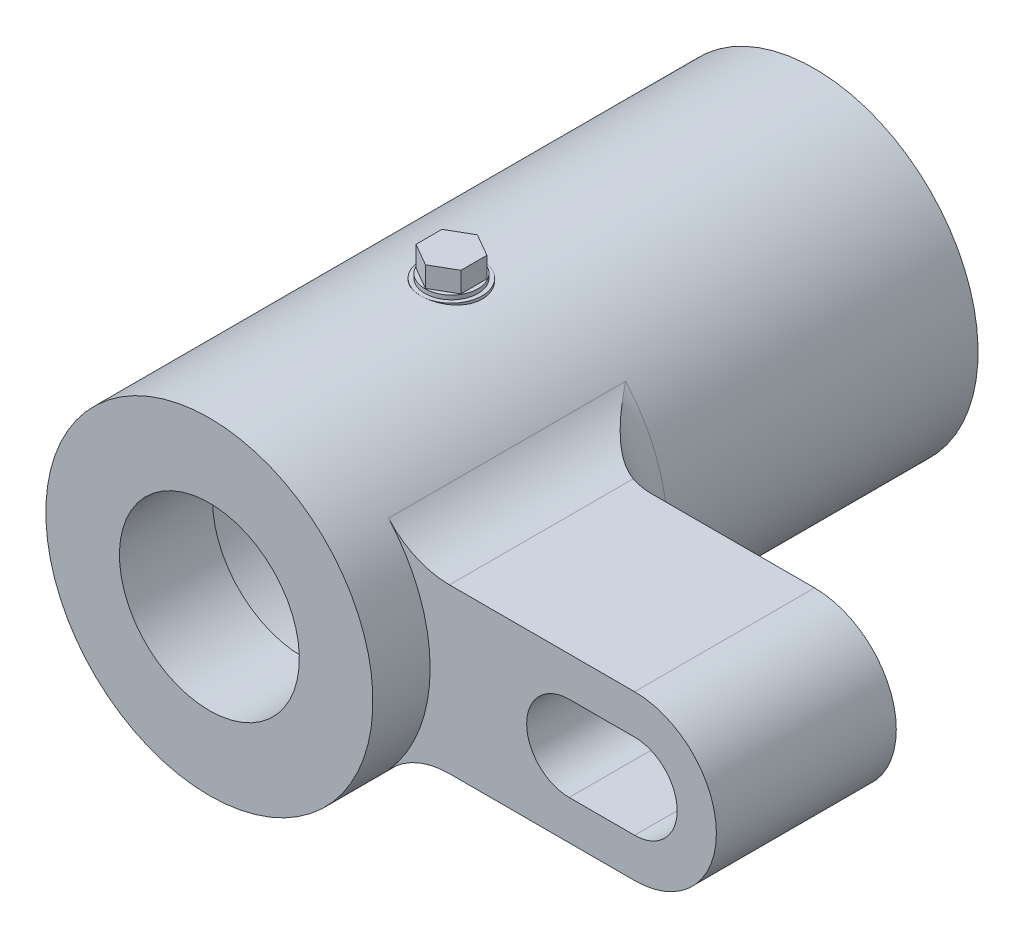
ISO-10303-21;
HEADER;
FILE_DESCRIPTION(('STEP AP214'),'2;1');
FILE_NAME('part.step','',(''),(''),'','','');
FILE_SCHEMA(('AUTOMOTIVE_DESIGN { 1 0 10303 214 1 1 1 1 }'));
ENDSEC;
DATA;
#1=APPLICATION_CONTEXT('core data for automotive mechanical design processes');
#2=APPLICATION_PROTOCOL_DEFINITION('international standard','automotive_design',2000,#1);
#3=PRODUCT_CONTEXT('',#1,'mechanical');
#4=PRODUCT('Part','Part','',(#3));
#5=PRODUCT_RELATED_PRODUCT_CATEGORY('part','',(#4));
#6=PRODUCT_DEFINITION_FORMATION('','',#4);
#7=PRODUCT_DEFINITION_CONTEXT('part definition',#1,'design');
#8=PRODUCT_DEFINITION('design','',#6,#7);
#9=PRODUCT_DEFINITION_SHAPE('','',#8);
#10=(LENGTH_UNIT() NAMED_UNIT(*) SI_UNIT(.MILLI.,.METRE.));
#11=(NAMED_UNIT(*) PLANE_ANGLE_UNIT() SI_UNIT($,.RADIAN.));
#12=(NAMED_UNIT(*) SI_UNIT($,.STERADIAN.) SOLID_ANGLE_UNIT());
#13=UNCERTAINTY_MEASURE_WITH_UNIT(LENGTH_MEASURE(1.E-05),#10,'distance_accuracy_value','');
#14=(GEOMETRIC_REPRESENTATION_CONTEXT(3) GLOBAL_UNCERTAINTY_ASSIGNED_CONTEXT((#13)) GLOBAL_UNIT_ASSIGNED_CONTEXT((#10,
#11,#12)) REPRESENTATION_CONTEXT('',''));
#15=CARTESIAN_POINT('',(0.,0.,0.));
#16=DIRECTION('',(0.,0.,1.));
#17=DIRECTION('',(1.,0.,0.));
#18=AXIS2_PLACEMENT_3D('',#15,#16,#17);
#19=CARTESIAN_POINT('',(0.,20.4999999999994,-29.6));
#20=DIRECTION('',(0.,1.,0.));
#21=DIRECTION('',(0.,0.,1.));
#22=AXIS2_PLACEMENT_3D('',#19,#20,#21);
#23=PLANE('',#22);
#24=CARTESIAN_POINT('',(0.,20.4999999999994,-29.6));
#25=DIRECTION('',(0.,1.,0.));
#26=DIRECTION('',(0.,0.,1.));
#27=AXIS2_PLACEMENT_3D('',#24,#25,#26);
#28=CIRCLE('',#27,3.25);
#29=CARTESIAN_POINT('',(0.,20.4999999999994,-26.35));
#30=VERTEX_POINT('',#29);
#31=EDGE_CURVE('E175',#30,#30,#28,.T.);
#32=ORIENTED_EDGE('',*,*,#31,.T.);
#33=EDGE_LOOP('',(#32));
#34=FACE_BOUND('',#33,.T.);
#35=DIRECTION('',(0.,0.,1.));
#36=VECTOR('',#35,1.);
#37=CARTESIAN_POINT('',(-2.75,20.4999999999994,-31.1877132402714));
#38=LINE('',#37,#36);
#39=CARTESIAN_POINT('',(-2.75,20.4999999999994,-31.1877132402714));
#40=VERTEX_POINT('',#39);
#41=CARTESIAN_POINT('',(-2.75,20.4999999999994,-28.0122867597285));
#42=VERTEX_POINT('',#41);
#43=EDGE_CURVE('E727',#40,#42,#38,.T.);
#44=ORIENTED_EDGE('',*,*,#43,.F.);
#45=DIRECTION('',(-0.866025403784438,0.,0.5));
#46=VECTOR('',#45,1.);
#47=CARTESIAN_POINT('',(0.,20.4999999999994,-32.7754264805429));
#48=LINE('',#47,#46);
#49=CARTESIAN_POINT('',(0.,20.4999999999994,-32.7754264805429));
#50=VERTEX_POINT('',#49);
#51=EDGE_CURVE('E170',#50,#40,#48,.T.);
#52=ORIENTED_EDGE('',*,*,#51,.F.);
#53=DIRECTION('',(-0.866025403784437,0.,-0.5));
#54=VECTOR('',#53,1.);
#55=CARTESIAN_POINT('',(2.75,20.4999999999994,-31.1877132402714));
#56=LINE('',#55,#54);
#57=CARTESIAN_POINT('',(2.75,20.4999999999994,-31.1877132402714));
#58=VERTEX_POINT('',#57);
#59=EDGE_CURVE('E166',#58,#50,#56,.T.);
#60=ORIENTED_EDGE('',*,*,#59,.F.);
#61=DIRECTION('',(0.,0.,-1.));
#62=VECTOR('',#61,1.);
#63=CARTESIAN_POINT('',(2.75,20.4999999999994,-28.0122867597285));
#64=LINE('',#63,#62);
#65=CARTESIAN_POINT('',(2.75,20.4999999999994,-28.0122867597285));
#66=VERTEX_POINT('',#65);
#67=EDGE_CURVE('E723',#66,#58,#64,.T.);
#68=ORIENTED_EDGE('',*,*,#67,.F.);
#69=DIRECTION('',(0.866025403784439,0.,-0.5));
#70=VECTOR('',#69,1.);
#71=CARTESIAN_POINT('',(0.,20.4999999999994,-26.4245735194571));
#72=LINE('',#71,#70);
#73=CARTESIAN_POINT('',(0.,20.4999999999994,-26.4245735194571));
#74=VERTEX_POINT('',#73);
#75=EDGE_CURVE('E735',#74,#66,#72,.T.);
#76=ORIENTED_EDGE('',*,*,#75,.F.);
#77=DIRECTION('',(0.866025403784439,0.,0.5));
#78=VECTOR('',#77,1.);
#79=CARTESIAN_POINT('',(-2.75,20.4999999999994,-28.0122867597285));
#80=LINE('',#79,#78);
#81=EDGE_CURVE('E729',#42,#74,#80,.T.);
#82=ORIENTED_EDGE('',*,*,#81,.F.);
#83=EDGE_LOOP('',(#44,#52,#60,#68,#76,#82));
#84=FACE_BOUND('',#83,.T.);
#85=ADVANCED_FACE('F14',(#34,#84),#23,.T.);
#86=CARTESIAN_POINT('',(0.,5.66723078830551E-13,-74.));
#87=DIRECTION('',(0.,0.,-1.));
#88=DIRECTION('',(0.,-1.,0.));
#89=AXIS2_PLACEMENT_3D('',#86,#87,#88);
#90=CYLINDRICAL_SURFACE('',#89,20.);
#91=CARTESIAN_POINT('',(0.,-19.9999999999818,-33.35));
#92=CARTESIAN_POINT('',(-0.208679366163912,-19.9999962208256,-33.3499920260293));
#93=CARTESIAN_POINT('',(-0.417462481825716,-19.9967002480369,-33.3325223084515));
#94=CARTESIAN_POINT('',(-0.829145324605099,-19.9838696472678,-33.263150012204));
#95=CARTESIAN_POINT('',(-1.03203993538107,-19.9743297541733,-33.2112183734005));
#96=CARTESIAN_POINT('',(-1.42593240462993,-19.9500784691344,-33.0745682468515));
#97=CARTESIAN_POINT('',(-1.6169408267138,-19.9353717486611,-32.9898793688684));
#98=CARTESIAN_POINT('',(-1.98201993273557,-19.9023927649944,-32.7902028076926));
#99=CARTESIAN_POINT('',(-2.15609198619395,-19.8841207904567,-32.6752175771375));
#100=CARTESIAN_POINT('',(-2.48445928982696,-19.8457834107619,-32.4167505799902));
#101=CARTESIAN_POINT('',(-2.63852238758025,-19.8257008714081,-32.272976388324));
#102=CARTESIAN_POINT('',(-2.92049015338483,-19.7861329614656,-31.9616417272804));
#103=CARTESIAN_POINT('',(-3.04839294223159,-19.7666476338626,-31.794079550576));
#104=CARTESIAN_POINT('',(-3.27537496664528,-19.7303137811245,-31.4382847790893));
#105=CARTESIAN_POINT('',(-3.37421804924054,-19.7134873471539,-31.2498990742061));
#106=CARTESIAN_POINT('',(-3.53876310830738,-19.6846178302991,-30.8588277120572));
#107=CARTESIAN_POINT('',(-3.60446794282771,-19.6725743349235,-30.6561432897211));
#108=CARTESIAN_POINT('',(-3.70012633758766,-19.6548067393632,-30.2447119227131));
#109=CARTESIAN_POINT('',(-3.73048475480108,-19.6490111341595,-30.0360622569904));
#110=CARTESIAN_POINT('',(-3.75584520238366,-19.6441799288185,-29.6165565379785));
#111=CARTESIAN_POINT('',(-3.7508504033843,-19.6451437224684,-29.4057006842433));
#112=CARTESIAN_POINT('',(-3.70597449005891,-19.6536573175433,-28.990701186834));
#113=CARTESIAN_POINT('',(-3.66655374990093,-19.6611202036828,-28.7865057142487));
#114=CARTESIAN_POINT('',(-3.55466998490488,-19.6816545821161,-28.3876789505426));
#115=CARTESIAN_POINT('',(-3.48220555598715,-19.6947263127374,-28.1930480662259));
#116=CARTESIAN_POINT('',(-3.30584117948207,-19.7250963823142,-27.8175283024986));
#117=CARTESIAN_POINT('',(-3.20175533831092,-19.7424195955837,-27.6367288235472));
#118=CARTESIAN_POINT('',(-2.96523422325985,-19.7793242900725,-27.2949881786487));
#119=CARTESIAN_POINT('',(-2.83279607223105,-19.7989060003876,-27.1340490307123));
#120=CARTESIAN_POINT('',(-2.54084764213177,-19.8385000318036,-26.8339376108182));
#121=CARTESIAN_POINT('',(-2.38094359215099,-19.8585142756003,-26.6951483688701));
#122=CARTESIAN_POINT('',(-2.03992009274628,-19.8964346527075,-26.446306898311));
#123=CARTESIAN_POINT('',(-1.85880043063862,-19.9143407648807,-26.3362549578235));
#124=CARTESIAN_POINT('',(-1.48008747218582,-19.9460634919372,-26.1479556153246));
#125=CARTESIAN_POINT('',(-1.28247391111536,-19.9598749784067,-26.069748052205));
#126=CARTESIAN_POINT('',(-0.876597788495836,-19.9818126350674,-25.9477447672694));
#127=CARTESIAN_POINT('',(-0.668336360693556,-19.9899394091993,-25.9039453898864));
#128=CARTESIAN_POINT('',(-0.250371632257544,-19.9995090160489,-25.8525349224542));
#129=CARTESIAN_POINT('',(-0.0407350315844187,-20.0010487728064,-25.8443990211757));
#130=CARTESIAN_POINT('',(0.376903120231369,-19.9975385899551,-25.8631386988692));
#131=CARTESIAN_POINT('',(0.584904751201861,-19.9924889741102,-25.8900125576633));
#132=CARTESIAN_POINT('',(0.991703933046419,-19.9764277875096,-25.9775725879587));
#133=CARTESIAN_POINT('',(1.19056065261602,-19.9654630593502,-26.0379932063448));
#134=CARTESIAN_POINT('',(1.57532157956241,-19.9387960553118,-26.1906442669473));
#135=CARTESIAN_POINT('',(1.76122490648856,-19.9230934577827,-26.2828768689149));
#136=CARTESIAN_POINT('',(2.11704167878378,-19.888450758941,-26.4976953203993));
#137=CARTESIAN_POINT('',(2.28675819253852,-19.8694771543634,-26.6206018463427));
#138=CARTESIAN_POINT('',(2.60334580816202,-19.8304835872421,-26.8928453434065));
#139=CARTESIAN_POINT('',(2.75021477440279,-19.8104635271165,-27.042184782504));
#140=CARTESIAN_POINT('',(3.01893239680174,-19.7713118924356,-27.3654307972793));
#141=CARTESIAN_POINT('',(3.14042290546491,-19.7521956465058,-27.5396372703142));
#142=CARTESIAN_POINT('',(3.35241687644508,-19.7173246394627,-27.9062940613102));
#143=CARTESIAN_POINT('',(3.44292149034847,-19.7015697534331,-28.098743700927));
#144=CARTESIAN_POINT('',(3.58986683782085,-19.6753256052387,-28.4955146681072));
#145=CARTESIAN_POINT('',(3.64647171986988,-19.6648110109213,-28.6997734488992));
#146=CARTESIAN_POINT('',(3.724516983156,-19.6501800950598,-29.1151180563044));
#147=CARTESIAN_POINT('',(3.74596133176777,-19.6460630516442,-29.3262031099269));
#148=CARTESIAN_POINT('',(3.75294405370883,-19.6447299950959,-29.7456208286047));
#149=CARTESIAN_POINT('',(3.73904737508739,-19.6474053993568,-29.9539439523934));
#150=CARTESIAN_POINT('',(3.67697938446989,-19.6591150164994,-30.3652285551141));
#151=CARTESIAN_POINT('',(3.62880827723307,-19.6681491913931,-30.5681900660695));
#152=CARTESIAN_POINT('',(3.49979718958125,-19.691512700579,-30.9626862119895));
#153=CARTESIAN_POINT('',(3.41901838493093,-19.7058321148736,-31.1542414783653));
#154=CARTESIAN_POINT('',(3.22714672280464,-19.7381596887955,-31.5211706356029));
#155=CARTESIAN_POINT('',(3.11605172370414,-19.7561681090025,-31.6965433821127));
#156=CARTESIAN_POINT('',(2.86473718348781,-19.7941816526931,-32.0289592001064));
#157=CARTESIAN_POINT('',(2.72410649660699,-19.8142126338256,-32.1856885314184));
#158=CARTESIAN_POINT('',(2.41856981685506,-19.8538208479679,-32.4735129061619));
#159=CARTESIAN_POINT('',(2.25365825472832,-19.8733979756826,-32.6046020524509));
#160=CARTESIAN_POINT('',(1.90246236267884,-19.9100993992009,-32.8385273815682));
#161=CARTESIAN_POINT('',(1.71599897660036,-19.927200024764,-32.9410985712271));
#162=CARTESIAN_POINT('',(1.32822528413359,-19.9567904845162,-33.1132940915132));
#163=CARTESIAN_POINT('',(1.12692912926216,-19.9692846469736,-33.1829493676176));
#164=CARTESIAN_POINT('',(0.77086800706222,-19.9857072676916,-33.2731932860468));
#165=CARTESIAN_POINT('',(0.618184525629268,-19.9910367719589,-33.3019465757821));
#166=CARTESIAN_POINT('',(0.310353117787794,-19.9981844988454,-33.3403526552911));
#167=CARTESIAN_POINT('',(0.155205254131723,-20.0000028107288,-33.3500059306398));
#168=CARTESIAN_POINT('',(0.,-19.9999999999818,-33.35));
#169=B_SPLINE_CURVE_WITH_KNOTS('',3,(#91,#92,#93,#94,#95,#96,#97,#98,#99,#100,#101,#102,#103,
#104,#105,#106,#107,#108,#109,#110,#111,#112,#113,#114,#115,#116,#117,#118,#119,#120,#121,#122,
#123,#124,#125,#126,#127,#128,#129,#130,#131,#132,#133,#134,#135,#136,#137,#138,#139,#140,#141,
#142,#143,#144,#145,#146,#147,#148,#149,#150,#151,#152,#153,#154,#155,#156,#157,#158,#159,#160,
#161,#162,#163,#164,#165,#166,#167,#168),.UNSPECIFIED.,.T.,.F.,(4,2,2,2,2,2,2,2,2,2,2,2,2,2,2,2,
2,2,2,2,2,2,2,2,2,2,2,2,2,2,2,2,2,2,2,2,2,2,4),(0.,0.62547050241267,1.25146910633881,
1.87690317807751,2.5022866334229,3.13437795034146,3.76651465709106,4.40365476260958,
5.04073990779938,5.67045378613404,6.30011118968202,6.92147501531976,7.54286524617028,
8.1679815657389,8.79316135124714,9.42819421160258,10.0632334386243,10.6990647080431,
11.3348284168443,11.9612043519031,12.5875495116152,13.2090058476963,13.8305043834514,
14.4587944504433,15.0871432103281,15.7238359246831,16.3605049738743,16.9940656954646,
17.6275549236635,18.2509813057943,18.8744039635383,19.496662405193,20.1189648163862,
20.7505842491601,21.382348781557,22.0198012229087,22.65665317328,23.1218586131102,
23.587052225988),.UNSPECIFIED.);
#170=CARTESIAN_POINT('',(0.,-19.9999999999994,-33.35));
#171=VERTEX_POINT('',#170);
#172=CARTESIAN_POINT('',(0.,-19.9999999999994,-25.85));
#173=VERTEX_POINT('',#172);
#174=EDGE_CURVE('E686',#171,#173,#169,.T.);
#175=ORIENTED_EDGE('',*,*,#174,.T.);
#176=CARTESIAN_POINT('',(0.,-19.9999999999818,-33.35));
#177=CARTESIAN_POINT('',(-0.208679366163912,-19.9999962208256,-33.3499920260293));
#178=CARTESIAN_POINT('',(-0.417462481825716,-19.9967002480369,-33.3325223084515));
#179=CARTESIAN_POINT('',(-0.829145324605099,-19.9838696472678,-33.263150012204));
#180=CARTESIAN_POINT('',(-1.03203993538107,-19.9743297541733,-33.2112183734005));
#181=CARTESIAN_POINT('',(-1.42593240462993,-19.9500784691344,-33.0745682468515));
#182=CARTESIAN_POINT('',(-1.6169408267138,-19.9353717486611,-32.9898793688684));
#183=CARTESIAN_POINT('',(-1.98201993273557,-19.9023927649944,-32.7902028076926));
#184=CARTESIAN_POINT('',(-2.15609198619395,-19.8841207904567,-32.6752175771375));
#185=CARTESIAN_POINT('',(-2.48445928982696,-19.8457834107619,-32.4167505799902));
#186=CARTESIAN_POINT('',(-2.63852238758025,-19.8257008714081,-32.272976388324));
#187=CARTESIAN_POINT('',(-2.92049015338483,-19.7861329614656,-31.9616417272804));
#188=CARTESIAN_POINT('',(-3.04839294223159,-19.7666476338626,-31.794079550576));
#189=CARTESIAN_POINT('',(-3.27537496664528,-19.7303137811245,-31.4382847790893));
#190=CARTESIAN_POINT('',(-3.37421804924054,-19.7134873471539,-31.2498990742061));
#191=CARTESIAN_POINT('',(-3.53876310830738,-19.6846178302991,-30.8588277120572));
#192=CARTESIAN_POINT('',(-3.60446794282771,-19.6725743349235,-30.6561432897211));
#193=CARTESIAN_POINT('',(-3.70012633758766,-19.6548067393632,-30.2447119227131));
#194=CARTESIAN_POINT('',(-3.73048475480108,-19.6490111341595,-30.0360622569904));
#195=CARTESIAN_POINT('',(-3.75584520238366,-19.6441799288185,-29.6165565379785));
#196=CARTESIAN_POINT('',(-3.7508504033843,-19.6451437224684,-29.4057006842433));
#197=CARTESIAN_POINT('',(-3.70597449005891,-19.6536573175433,-28.990701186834));
#198=CARTESIAN_POINT('',(-3.66655374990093,-19.6611202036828,-28.7865057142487));
#199=CARTESIAN_POINT('',(-3.55466998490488,-19.6816545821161,-28.3876789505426));
#200=CARTESIAN_POINT('',(-3.48220555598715,-19.6947263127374,-28.1930480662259));
#201=CARTESIAN_POINT('',(-3.30584117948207,-19.7250963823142,-27.8175283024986));
#202=CARTESIAN_POINT('',(-3.20175533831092,-19.7424195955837,-27.6367288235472));
#203=CARTESIAN_POINT('',(-2.96523422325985,-19.7793242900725,-27.2949881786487));
#204=CARTESIAN_POINT('',(-2.83279607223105,-19.7989060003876,-27.1340490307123));
#205=CARTESIAN_POINT('',(-2.54084764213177,-19.8385000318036,-26.8339376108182));
#206=CARTESIAN_POINT('',(-2.38094359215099,-19.8585142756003,-26.6951483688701));
#207=CARTESIAN_POINT('',(-2.03992009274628,-19.8964346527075,-26.446306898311));
#208=CARTESIAN_POINT('',(-1.85880043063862,-19.9143407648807,-26.3362549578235));
#209=CARTESIAN_POINT('',(-1.48008747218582,-19.9460634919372,-26.1479556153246));
#210=CARTESIAN_POINT('',(-1.28247391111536,-19.9598749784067,-26.069748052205));
#211=CARTESIAN_POINT('',(-0.876597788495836,-19.9818126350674,-25.9477447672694));
#212=CARTESIAN_POINT('',(-0.668336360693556,-19.9899394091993,-25.9039453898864));
#213=CARTESIAN_POINT('',(-0.250371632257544,-19.9995090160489,-25.8525349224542));
#214=CARTESIAN_POINT('',(-0.0407350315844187,-20.0010487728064,-25.8443990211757));
#215=CARTESIAN_POINT('',(0.376903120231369,-19.9975385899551,-25.8631386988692));
#216=CARTESIAN_POINT('',(0.584904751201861,-19.9924889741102,-25.8900125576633));
#217=CARTESIAN_POINT('',(0.991703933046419,-19.9764277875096,-25.9775725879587));
#218=CARTESIAN_POINT('',(1.19056065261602,-19.9654630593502,-26.0379932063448));
#219=CARTESIAN_POINT('',(1.57532157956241,-19.9387960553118,-26.1906442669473));
#220=CARTESIAN_POINT('',(1.76122490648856,-19.9230934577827,-26.2828768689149));
#221=CARTESIAN_POINT('',(2.11704167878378,-19.888450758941,-26.4976953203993));
#222=CARTESIAN_POINT('',(2.28675819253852,-19.8694771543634,-26.6206018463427));
#223=CARTESIAN_POINT('',(2.60334580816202,-19.8304835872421,-26.8928453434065));
#224=CARTESIAN_POINT('',(2.75021477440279,-19.8104635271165,-27.042184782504));
#225=CARTESIAN_POINT('',(3.01893239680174,-19.7713118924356,-27.3654307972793));
#226=CARTESIAN_POINT('',(3.14042290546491,-19.7521956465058,-27.5396372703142));
#227=CARTESIAN_POINT('',(3.35241687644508,-19.7173246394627,-27.9062940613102));
#228=CARTESIAN_POINT('',(3.44292149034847,-19.7015697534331,-28.098743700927));
#229=CARTESIAN_POINT('',(3.58986683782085,-19.6753256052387,-28.4955146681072));
#230=CARTESIAN_POINT('',(3.64647171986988,-19.6648110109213,-28.6997734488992));
#231=CARTESIAN_POINT('',(3.724516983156,-19.6501800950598,-29.1151180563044));
#232=CARTESIAN_POINT('',(3.74596133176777,-19.6460630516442,-29.3262031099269));
#233=CARTESIAN_POINT('',(3.75294405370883,-19.6447299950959,-29.7456208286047));
#234=CARTESIAN_POINT('',(3.73904737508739,-19.6474053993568,-29.9539439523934));
#235=CARTESIAN_POINT('',(3.67697938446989,-19.6591150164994,-30.3652285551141));
#236=CARTESIAN_POINT('',(3.62880827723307,-19.6681491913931,-30.5681900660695));
#237=CARTESIAN_POINT('',(3.49979718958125,-19.691512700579,-30.9626862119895));
#238=CARTESIAN_POINT('',(3.41901838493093,-19.7058321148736,-31.1542414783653));
#239=CARTESIAN_POINT('',(3.22714672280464,-19.7381596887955,-31.5211706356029));
#240=CARTESIAN_POINT('',(3.11605172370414,-19.7561681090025,-31.6965433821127));
#241=CARTESIAN_POINT('',(2.86473718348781,-19.7941816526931,-32.0289592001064));
#242=CARTESIAN_POINT('',(2.72410649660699,-19.8142126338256,-32.1856885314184));
#243=CARTESIAN_POINT('',(2.41856981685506,-19.8538208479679,-32.4735129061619));
#244=CARTESIAN_POINT('',(2.25365825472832,-19.8733979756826,-32.6046020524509));
#245=CARTESIAN_POINT('',(1.90246236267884,-19.9100993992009,-32.8385273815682));
#246=CARTESIAN_POINT('',(1.71599897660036,-19.927200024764,-32.9410985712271));
#247=CARTESIAN_POINT('',(1.32822528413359,-19.9567904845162,-33.1132940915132));
#248=CARTESIAN_POINT('',(1.12692912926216,-19.9692846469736,-33.1829493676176));
#249=CARTESIAN_POINT('',(0.77086800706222,-19.9857072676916,-33.2731932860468));
#250=CARTESIAN_POINT('',(0.618184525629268,-19.9910367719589,-33.3019465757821));
#251=CARTESIAN_POINT('',(0.310353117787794,-19.9981844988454,-33.3403526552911));
#252=CARTESIAN_POINT('',(0.155205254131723,-20.0000028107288,-33.3500059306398));
#253=CARTESIAN_POINT('',(0.,-19.9999999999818,-33.35));
#254=B_SPLINE_CURVE_WITH_KNOTS('',3,(#176,#177,#178,#179,#180,#181,#182,#183,#184,#185,#186,
#187,#188,#189,#190,#191,#192,#193,#194,#195,#196,#197,#198,#199,#200,#201,#202,#203,#204,#205,
#206,#207,#208,#209,#210,#211,#212,#213,#214,#215,#216,#217,#218,#219,#220,#221,#222,#223,#224,
#225,#226,#227,#228,#229,#230,#231,#232,#233,#234,#235,#236,#237,#238,#239,#240,#241,#242,#243,
#244,#245,#246,#247,#248,#249,#250,#251,#252,#253),.UNSPECIFIED.,.T.,.F.,(4,2,2,2,2,2,2,2,2,2,2,
2,2,2,2,2,2,2,2,2,2,2,2,2,2,2,2,2,2,2,2,2,2,2,2,2,2,2,4),(0.,0.62547050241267,1.25146910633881,
1.87690317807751,2.5022866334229,3.13437795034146,3.76651465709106,4.40365476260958,
5.04073990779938,5.67045378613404,6.30011118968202,6.92147501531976,7.54286524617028,
8.1679815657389,8.79316135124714,9.42819421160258,10.0632334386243,10.6990647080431,
11.3348284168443,11.9612043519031,12.5875495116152,13.2090058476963,13.8305043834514,
14.4587944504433,15.0871432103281,15.7238359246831,16.3605049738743,16.9940656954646,
17.6275549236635,18.2509813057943,18.8744039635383,19.496662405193,20.1189648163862,
20.7505842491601,21.382348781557,22.0198012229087,22.65665317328,23.1218586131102,
23.587052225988),.UNSPECIFIED.);
#255=EDGE_CURVE('E554',#173,#171,#254,.T.);
#256=ORIENTED_EDGE('',*,*,#255,.T.);
#257=EDGE_LOOP('',(#175,#256));
#258=FACE_BOUND('',#257,.T.);
#259=DIRECTION('',(0.,0.,-1.));
#260=VECTOR('',#259,1.);
#261=CARTESIAN_POINT('',(14.9071198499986,13.3333333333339,-74.));
#262=LINE('',#261,#260);
#263=CARTESIAN_POINT('',(14.9071198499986,13.3333333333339,-7.));
#264=VERTEX_POINT('',#263);
#265=CARTESIAN_POINT('',(14.9071198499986,13.3333333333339,-36.));
#266=VERTEX_POINT('',#265);
#267=EDGE_CURVE('E625',#264,#266,#262,.T.);
#268=ORIENTED_EDGE('',*,*,#267,.T.);
#269=CARTESIAN_POINT('',(0.,5.66723078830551E-13,-36.));
#270=DIRECTION('',(0.,0.,-1.));
#271=DIRECTION('',(0.,-1.,0.));
#272=AXIS2_PLACEMENT_3D('',#269,#270,#271);
#273=CIRCLE('',#272,20.);
#274=CARTESIAN_POINT('',(14.9071198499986,-13.3333333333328,-36.));
#275=VERTEX_POINT('',#274);
#276=EDGE_CURVE('E632',#266,#275,#273,.T.);
#277=ORIENTED_EDGE('',*,*,#276,.T.);
#278=DIRECTION('',(0.,0.,-1.));
#279=VECTOR('',#278,1.);
#280=CARTESIAN_POINT('',(14.9071198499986,-13.3333333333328,-74.));
#281=LINE('',#280,#279);
#282=CARTESIAN_POINT('',(14.9071198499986,-13.3333333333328,-7.));
#283=VERTEX_POINT('',#282);
#284=EDGE_CURVE('E627',#275,#283,#281,.F.);
#285=ORIENTED_EDGE('',*,*,#284,.T.);
#286=CARTESIAN_POINT('',(0.,5.66723078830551E-13,-7.));
#287=DIRECTION('',(0.,0.,1.));
#288=DIRECTION('',(0.,1.,0.));
#289=AXIS2_PLACEMENT_3D('',#286,#287,#288);
#290=CIRCLE('',#289,20.);
#291=EDGE_CURVE('E597',#283,#264,#290,.T.);
#292=ORIENTED_EDGE('',*,*,#291,.T.);
#293=EDGE_LOOP('',(#268,#277,#285,#292));
#294=FACE_BOUND('',#293,.T.);
#295=CARTESIAN_POINT('',(0.,5.66723078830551E-13,0.));
#296=DIRECTION('',(0.,0.,-1.));
#297=DIRECTION('',(0.,-1.,0.));
#298=AXIS2_PLACEMENT_3D('',#295,#296,#297);
#299=CIRCLE('',#298,20.);
#300=CARTESIAN_POINT('',(0.,-19.9999999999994,0.));
#301=VERTEX_POINT('',#300);
#302=EDGE_CURVE('E594',#301,#301,#299,.T.);
#303=ORIENTED_EDGE('',*,*,#302,.T.);
#304=EDGE_LOOP('',(#303));
#305=FACE_BOUND('',#304,.T.);
#306=CARTESIAN_POINT('',(0.,5.66723078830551E-13,-74.));
#307=DIRECTION('',(0.,0.,-1.));
#308=DIRECTION('',(-1.,0.,0.));
#309=AXIS2_PLACEMENT_3D('',#306,#307,#308);
#310=CIRCLE('',#309,20.);
#311=CARTESIAN_POINT('',(-20.,5.66723078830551E-13,-74.));
#312=VERTEX_POINT('',#311);
#313=EDGE_CURVE('E576',#312,#312,#310,.T.);
#314=ORIENTED_EDGE('',*,*,#313,.F.);
#315=EDGE_LOOP('',(#314));
#316=FACE_BOUND('',#315,.T.);
#317=CARTESIAN_POINT('',(0.,19.9999999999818,-25.85));
#318=CARTESIAN_POINT('',(0.208679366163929,19.9999962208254,-25.8500079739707));
#319=CARTESIAN_POINT('',(0.417462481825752,19.9967002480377,-25.8674776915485));
#320=CARTESIAN_POINT('',(0.829145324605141,19.9838696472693,-25.936849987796));
#321=CARTESIAN_POINT('',(1.0320399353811,19.9743297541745,-25.9887816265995));
#322=CARTESIAN_POINT('',(1.42593240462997,19.9500784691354,-26.1254317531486));
#323=CARTESIAN_POINT('',(1.61694082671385,19.9353717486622,-26.2101206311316));
#324=CARTESIAN_POINT('',(1.98201993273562,19.9023927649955,-26.4097971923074));
#325=CARTESIAN_POINT('',(2.156091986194,19.8841207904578,-26.5247824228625));
#326=CARTESIAN_POINT('',(2.484459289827,19.845783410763,-26.7832494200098));
#327=CARTESIAN_POINT('',(2.6385223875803,19.8257008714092,-26.9270236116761));
#328=CARTESIAN_POINT('',(2.92049015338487,19.7861329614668,-27.2383582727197));
#329=CARTESIAN_POINT('',(3.04839294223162,19.7666476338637,-27.405920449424));
#330=CARTESIAN_POINT('',(3.2753749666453,19.7303137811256,-27.7617152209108));
#331=CARTESIAN_POINT('',(3.37421804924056,19.713487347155,-27.950100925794));
#332=CARTESIAN_POINT('',(3.5387631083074,19.6846178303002,-28.3411722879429));
#333=CARTESIAN_POINT('',(3.60446794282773,19.6725743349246,-28.543856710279));
#334=CARTESIAN_POINT('',(3.70012633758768,19.6548067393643,-28.955288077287));
#335=CARTESIAN_POINT('',(3.73048475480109,19.6490111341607,-29.1639377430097));
#336=CARTESIAN_POINT('',(3.75584520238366,19.6441799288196,-29.5834434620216));
#337=CARTESIAN_POINT('',(3.7508504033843,19.6451437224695,-29.7942993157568));
#338=CARTESIAN_POINT('',(3.7059744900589,19.6536573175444,-30.2092988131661));
#339=CARTESIAN_POINT('',(3.66655374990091,19.661120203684,-30.4134942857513));
#340=CARTESIAN_POINT('',(3.55466998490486,19.6816545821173,-30.8123210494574));
#341=CARTESIAN_POINT('',(3.48220555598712,19.6947263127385,-31.0069519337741));
#342=CARTESIAN_POINT('',(3.30584117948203,19.7250963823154,-31.3824716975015));
#343=CARTESIAN_POINT('',(3.20175533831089,19.7424195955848,-31.5632711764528));
#344=CARTESIAN_POINT('',(2.96523422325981,19.7793242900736,-31.9050118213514));
#345=CARTESIAN_POINT('',(2.83279607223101,19.7989060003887,-32.0659509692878));
#346=CARTESIAN_POINT('',(2.54084764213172,19.8385000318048,-32.3660623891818));
#347=CARTESIAN_POINT('',(2.38094359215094,19.8585142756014,-32.50485163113));
#348=CARTESIAN_POINT('',(2.03992009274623,19.8964346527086,-32.7536931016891));
#349=CARTESIAN_POINT('',(1.85880043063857,19.9143407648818,-32.8637450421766));
#350=CARTESIAN_POINT('',(1.48008747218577,19.9460634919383,-33.0520443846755));
#351=CARTESIAN_POINT('',(1.2824739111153,19.9598749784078,-33.1302519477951));
#352=CARTESIAN_POINT('',(0.876597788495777,19.9818126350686,-33.2522552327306));
#353=CARTESIAN_POINT('',(0.668336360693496,19.9899394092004,-33.2960546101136));
#354=CARTESIAN_POINT('',(0.250371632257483,19.9995090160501,-33.3474650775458));
#355=CARTESIAN_POINT('',(0.040735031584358,20.0010487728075,-33.3556009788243));
#356=CARTESIAN_POINT('',(-0.376903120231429,19.9975385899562,-33.3368613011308));
#357=CARTESIAN_POINT('',(-0.584904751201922,19.9924889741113,-33.3099874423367));
#358=CARTESIAN_POINT('',(-0.991703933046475,19.9764277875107,-33.2224274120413));
#359=CARTESIAN_POINT('',(-1.19056065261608,19.9654630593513,-33.1620067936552));
#360=CARTESIAN_POINT('',(-1.57532157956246,19.938796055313,-33.0093557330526));
#361=CARTESIAN_POINT('',(-1.76122490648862,19.9230934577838,-32.9171231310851));
#362=CARTESIAN_POINT('',(-2.11704167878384,19.8884507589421,-32.7023046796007));
#363=CARTESIAN_POINT('',(-2.28675819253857,19.8694771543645,-32.5793981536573));
#364=CARTESIAN_POINT('',(-2.60334580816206,19.8304835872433,-32.3071546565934));
#365=CARTESIAN_POINT('',(-2.75021477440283,19.8104635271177,-32.157815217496));
#366=CARTESIAN_POINT('',(-3.01893239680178,19.7713118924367,-31.8345692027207));
#367=CARTESIAN_POINT('',(-3.14042290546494,19.7521956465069,-31.6603627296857));
#368=CARTESIAN_POINT('',(-3.35241687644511,19.7173246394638,-31.2937059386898));
#369=CARTESIAN_POINT('',(-3.4429214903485,19.7015697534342,-31.1012562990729));
#370=CARTESIAN_POINT('',(-3.58986683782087,19.6753256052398,-30.7044853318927));
#371=CARTESIAN_POINT('',(-3.64647171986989,19.6648110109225,-30.5002265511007));
#372=CARTESIAN_POINT('',(-3.72451698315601,19.6501800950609,-30.0848819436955));
#373=CARTESIAN_POINT('',(-3.74596133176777,19.6460630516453,-29.873796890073));
#374=CARTESIAN_POINT('',(-3.75294405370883,19.644729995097,-29.4543791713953));
#375=CARTESIAN_POINT('',(-3.73904737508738,19.6474053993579,-29.2460560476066));
#376=CARTESIAN_POINT('',(-3.67697938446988,19.6591150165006,-28.8347714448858));
#377=CARTESIAN_POINT('',(-3.62880827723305,19.6681491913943,-28.6318099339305));
#378=CARTESIAN_POINT('',(-3.49979718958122,19.6915127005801,-28.2373137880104));
#379=CARTESIAN_POINT('',(-3.4190183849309,19.7058321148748,-28.0457585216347));
#380=CARTESIAN_POINT('',(-3.2271467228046,19.7381596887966,-27.678829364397));
#381=CARTESIAN_POINT('',(-3.1160517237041,19.7561681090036,-27.5034566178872));
#382=CARTESIAN_POINT('',(-2.86473718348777,19.7941816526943,-27.1710407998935));
#383=CARTESIAN_POINT('',(-2.72410649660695,19.8142126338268,-27.0143114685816));
#384=CARTESIAN_POINT('',(-2.41856981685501,19.853820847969,-26.7264870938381));
#385=CARTESIAN_POINT('',(-2.25365825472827,19.8733979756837,-26.5953979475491));
#386=CARTESIAN_POINT('',(-1.90246236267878,19.910099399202,-26.3614726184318));
#387=CARTESIAN_POINT('',(-1.71599897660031,19.9272000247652,-26.2589014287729));
#388=CARTESIAN_POINT('',(-1.32822528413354,19.9567904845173,-26.0867059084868));
#389=CARTESIAN_POINT('',(-1.1269291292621,19.9692846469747,-26.0170506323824));
#390=CARTESIAN_POINT('',(-0.770868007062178,19.9857072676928,-25.9268067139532));
#391=CARTESIAN_POINT('',(-0.618184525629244,19.9910367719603,-25.8980534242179));
#392=CARTESIAN_POINT('',(-0.310353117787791,19.9981844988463,-25.8596473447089));
#393=CARTESIAN_POINT('',(-0.155205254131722,20.0000028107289,-25.8499940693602));
#394=CARTESIAN_POINT('',(0.,19.9999999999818,-25.85));
#395=B_SPLINE_CURVE_WITH_KNOTS('',3,(#317,#318,#319,#320,#321,#322,#323,#324,#325,#326,#327,
#328,#329,#330,#331,#332,#333,#334,#335,#336,#337,#338,#339,#340,#341,#342,#343,#344,#345,#346,
#347,#348,#349,#350,#351,#352,#353,#354,#355,#356,#357,#358,#359,#360,#361,#362,#363,#364,#365,
#366,#367,#368,#369,#370,#371,#372,#373,#374,#375,#376,#377,#378,#379,#380,#381,#382,#383,#384,
#385,#386,#387,#388,#389,#390,#391,#392,#393,#394),.UNSPECIFIED.,.T.,.F.,(4,2,2,2,2,2,2,2,2,2,2,
2,2,2,2,2,2,2,2,2,2,2,2,2,2,2,2,2,2,2,2,2,2,2,2,2,2,2,4),(0.,0.625470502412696,1.25146910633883,
1.87690317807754,2.50228663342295,3.1343779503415,3.76651465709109,4.40365476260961,
5.04073990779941,5.67045378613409,6.3001111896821,6.92147501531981,7.54286524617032,
8.16798156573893,8.79316135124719,9.42819421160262,10.0632334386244,10.6990647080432,
11.3348284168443,11.9612043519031,12.5875495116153,13.2090058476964,13.8305043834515,
14.4587944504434,15.0871432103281,15.7238359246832,16.3605049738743,16.9940656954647,
17.6275549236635,18.2509813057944,18.8744039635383,19.496662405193,20.1189648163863,
20.7505842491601,21.3823487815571,22.0198012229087,22.65665317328,23.1218586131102,
23.587052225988),.UNSPECIFIED.);
#396=CARTESIAN_POINT('',(0.,19.9999999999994,-33.35));
#397=VERTEX_POINT('',#396);
#398=CARTESIAN_POINT('',(0.,19.9999999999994,-25.85));
#399=VERTEX_POINT('',#398);
#400=EDGE_CURVE('E683',#397,#399,#395,.T.);
#401=ORIENTED_EDGE('',*,*,#400,.F.);
#402=CARTESIAN_POINT('',(0.,19.9999999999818,-25.85));
#403=CARTESIAN_POINT('',(0.208679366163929,19.9999962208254,-25.8500079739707));
#404=CARTESIAN_POINT('',(0.417462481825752,19.9967002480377,-25.8674776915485));
#405=CARTESIAN_POINT('',(0.829145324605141,19.9838696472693,-25.936849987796));
#406=CARTESIAN_POINT('',(1.0320399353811,19.9743297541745,-25.9887816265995));
#407=CARTESIAN_POINT('',(1.42593240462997,19.9500784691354,-26.1254317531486));
#408=CARTESIAN_POINT('',(1.61694082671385,19.9353717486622,-26.2101206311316));
#409=CARTESIAN_POINT('',(1.98201993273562,19.9023927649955,-26.4097971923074));
#410=CARTESIAN_POINT('',(2.156091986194,19.8841207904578,-26.5247824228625));
#411=CARTESIAN_POINT('',(2.484459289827,19.845783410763,-26.7832494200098));
#412=CARTESIAN_POINT('',(2.6385223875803,19.8257008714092,-26.9270236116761));
#413=CARTESIAN_POINT('',(2.92049015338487,19.7861329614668,-27.2383582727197));
#414=CARTESIAN_POINT('',(3.04839294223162,19.7666476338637,-27.405920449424));
#415=CARTESIAN_POINT('',(3.2753749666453,19.7303137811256,-27.7617152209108));
#416=CARTESIAN_POINT('',(3.37421804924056,19.713487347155,-27.950100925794));
#417=CARTESIAN_POINT('',(3.5387631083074,19.6846178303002,-28.3411722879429));
#418=CARTESIAN_POINT('',(3.60446794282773,19.6725743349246,-28.543856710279));
#419=CARTESIAN_POINT('',(3.70012633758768,19.6548067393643,-28.955288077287));
#420=CARTESIAN_POINT('',(3.73048475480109,19.6490111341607,-29.1639377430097));
#421=CARTESIAN_POINT('',(3.75584520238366,19.6441799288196,-29.5834434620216));
#422=CARTESIAN_POINT('',(3.7508504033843,19.6451437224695,-29.7942993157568));
#423=CARTESIAN_POINT('',(3.7059744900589,19.6536573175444,-30.2092988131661));
#424=CARTESIAN_POINT('',(3.66655374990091,19.661120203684,-30.4134942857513));
#425=CARTESIAN_POINT('',(3.55466998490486,19.6816545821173,-30.8123210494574));
#426=CARTESIAN_POINT('',(3.48220555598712,19.6947263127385,-31.0069519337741));
#427=CARTESIAN_POINT('',(3.30584117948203,19.7250963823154,-31.3824716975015));
#428=CARTESIAN_POINT('',(3.20175533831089,19.7424195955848,-31.5632711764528));
#429=CARTESIAN_POINT('',(2.96523422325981,19.7793242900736,-31.9050118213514));
#430=CARTESIAN_POINT('',(2.83279607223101,19.7989060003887,-32.0659509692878));
#431=CARTESIAN_POINT('',(2.54084764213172,19.8385000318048,-32.3660623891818));
#432=CARTESIAN_POINT('',(2.38094359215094,19.8585142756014,-32.50485163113));
#433=CARTESIAN_POINT('',(2.03992009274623,19.8964346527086,-32.7536931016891));
#434=CARTESIAN_POINT('',(1.85880043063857,19.9143407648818,-32.8637450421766));
#435=CARTESIAN_POINT('',(1.48008747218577,19.9460634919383,-33.0520443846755));
#436=CARTESIAN_POINT('',(1.2824739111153,19.9598749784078,-33.1302519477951));
#437=CARTESIAN_POINT('',(0.876597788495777,19.9818126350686,-33.2522552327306));
#438=CARTESIAN_POINT('',(0.668336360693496,19.9899394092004,-33.2960546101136));
#439=CARTESIAN_POINT('',(0.250371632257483,19.9995090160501,-33.3474650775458));
#440=CARTESIAN_POINT('',(0.040735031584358,20.0010487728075,-33.3556009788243));
#441=CARTESIAN_POINT('',(-0.376903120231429,19.9975385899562,-33.3368613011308));
#442=CARTESIAN_POINT('',(-0.584904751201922,19.9924889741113,-33.3099874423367));
#443=CARTESIAN_POINT('',(-0.991703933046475,19.9764277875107,-33.2224274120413));
#444=CARTESIAN_POINT('',(-1.19056065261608,19.9654630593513,-33.1620067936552));
#445=CARTESIAN_POINT('',(-1.57532157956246,19.938796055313,-33.0093557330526));
#446=CARTESIAN_POINT('',(-1.76122490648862,19.9230934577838,-32.9171231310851));
#447=CARTESIAN_POINT('',(-2.11704167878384,19.8884507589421,-32.7023046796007));
#448=CARTESIAN_POINT('',(-2.28675819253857,19.8694771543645,-32.5793981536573));
#449=CARTESIAN_POINT('',(-2.60334580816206,19.8304835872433,-32.3071546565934));
#450=CARTESIAN_POINT('',(-2.75021477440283,19.8104635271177,-32.157815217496));
#451=CARTESIAN_POINT('',(-3.01893239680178,19.7713118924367,-31.8345692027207));
#452=CARTESIAN_POINT('',(-3.14042290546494,19.7521956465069,-31.6603627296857));
#453=CARTESIAN_POINT('',(-3.35241687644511,19.7173246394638,-31.2937059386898));
#454=CARTESIAN_POINT('',(-3.4429214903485,19.7015697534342,-31.1012562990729));
#455=CARTESIAN_POINT('',(-3.58986683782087,19.6753256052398,-30.7044853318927));
#456=CARTESIAN_POINT('',(-3.64647171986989,19.6648110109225,-30.5002265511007));
#457=CARTESIAN_POINT('',(-3.72451698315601,19.6501800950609,-30.0848819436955));
#458=CARTESIAN_POINT('',(-3.74596133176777,19.6460630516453,-29.873796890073));
#459=CARTESIAN_POINT('',(-3.75294405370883,19.644729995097,-29.4543791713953));
#460=CARTESIAN_POINT('',(-3.73904737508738,19.6474053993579,-29.2460560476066));
#461=CARTESIAN_POINT('',(-3.67697938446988,19.6591150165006,-28.8347714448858));
#462=CARTESIAN_POINT('',(-3.62880827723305,19.6681491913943,-28.6318099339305));
#463=CARTESIAN_POINT('',(-3.49979718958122,19.6915127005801,-28.2373137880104));
#464=CARTESIAN_POINT('',(-3.4190183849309,19.7058321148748,-28.0457585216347));
#465=CARTESIAN_POINT('',(-3.2271467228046,19.7381596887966,-27.678829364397));
#466=CARTESIAN_POINT('',(-3.1160517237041,19.7561681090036,-27.5034566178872));
#467=CARTESIAN_POINT('',(-2.86473718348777,19.7941816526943,-27.1710407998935));
#468=CARTESIAN_POINT('',(-2.72410649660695,19.8142126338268,-27.0143114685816));
#469=CARTESIAN_POINT('',(-2.41856981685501,19.853820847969,-26.7264870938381));
#470=CARTESIAN_POINT('',(-2.25365825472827,19.8733979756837,-26.5953979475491));
#471=CARTESIAN_POINT('',(-1.90246236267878,19.910099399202,-26.3614726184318));
#472=CARTESIAN_POINT('',(-1.71599897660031,19.9272000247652,-26.2589014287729));
#473=CARTESIAN_POINT('',(-1.32822528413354,19.9567904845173,-26.0867059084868));
#474=CARTESIAN_POINT('',(-1.1269291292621,19.9692846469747,-26.0170506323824));
#475=CARTESIAN_POINT('',(-0.770868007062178,19.9857072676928,-25.9268067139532));
#476=CARTESIAN_POINT('',(-0.618184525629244,19.9910367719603,-25.8980534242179));
#477=CARTESIAN_POINT('',(-0.310353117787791,19.9981844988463,-25.8596473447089));
#478=CARTESIAN_POINT('',(-0.155205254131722,20.0000028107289,-25.8499940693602));
#479=CARTESIAN_POINT('',(0.,19.9999999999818,-25.85));
#480=B_SPLINE_CURVE_WITH_KNOTS('',3,(#402,#403,#404,#405,#406,#407,#408,#409,#410,#411,#412,
#413,#414,#415,#416,#417,#418,#419,#420,#421,#422,#423,#424,#425,#426,#427,#428,#429,#430,#431,
#432,#433,#434,#435,#436,#437,#438,#439,#440,#441,#442,#443,#444,#445,#446,#447,#448,#449,#450,
#451,#452,#453,#454,#455,#456,#457,#458,#459,#460,#461,#462,#463,#464,#465,#466,#467,#468,#469,
#470,#471,#472,#473,#474,#475,#476,#477,#478,#479),.UNSPECIFIED.,.T.,.F.,(4,2,2,2,2,2,2,2,2,2,2,
2,2,2,2,2,2,2,2,2,2,2,2,2,2,2,2,2,2,2,2,2,2,2,2,2,2,2,4),(0.,0.625470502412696,1.25146910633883,
1.87690317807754,2.50228663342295,3.1343779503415,3.76651465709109,4.40365476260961,
5.04073990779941,5.67045378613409,6.3001111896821,6.92147501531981,7.54286524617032,
8.16798156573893,8.79316135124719,9.42819421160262,10.0632334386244,10.6990647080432,
11.3348284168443,11.9612043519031,12.5875495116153,13.2090058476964,13.8305043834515,
14.4587944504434,15.0871432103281,15.7238359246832,16.3605049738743,16.9940656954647,
17.6275549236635,18.2509813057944,18.8744039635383,19.496662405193,20.1189648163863,
20.7505842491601,21.3823487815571,22.0198012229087,22.65665317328,23.1218586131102,
23.587052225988),.UNSPECIFIED.);
#481=EDGE_CURVE('E184',#399,#397,#480,.T.);
#482=ORIENTED_EDGE('',*,*,#481,.F.);
#483=EDGE_LOOP('',(#401,#482));
#484=FACE_BOUND('',#483,.T.);
#485=ADVANCED_FACE('F205',(#258,#294,#305,#316,#484),#90,.T.);
#486=CARTESIAN_POINT('',(0.,5.66723078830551E-13,-74.));
#487=DIRECTION('',(0.,0.,-1.));
#488=DIRECTION('',(0.,-1.,0.));
#489=AXIS2_PLACEMENT_3D('',#486,#487,#488);
#490=CYLINDRICAL_SURFACE('',#489,11.);
#491=CARTESIAN_POINT('',(0.,5.66723078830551E-13,0.));
#492=DIRECTION('',(0.,0.,-1.));
#493=DIRECTION('',(0.,-1.,0.));
#494=AXIS2_PLACEMENT_3D('',#491,#492,#493);
#495=CIRCLE('',#494,11.);
#496=CARTESIAN_POINT('',(0.,-10.9999999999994,0.));
#497=VERTEX_POINT('',#496);
#498=EDGE_CURVE('E603',#497,#497,#495,.T.);
#499=ORIENTED_EDGE('',*,*,#498,.F.);
#500=EDGE_LOOP('',(#499));
#501=FACE_BOUND('',#500,.T.);
#502=CARTESIAN_POINT('',(0.,5.66723078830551E-13,-11.4));
#503=DIRECTION('',(0.,0.,-1.));
#504=DIRECTION('',(-1.,0.,0.));
#505=AXIS2_PLACEMENT_3D('',#502,#503,#504);
#506=CIRCLE('',#505,11.);
#507=CARTESIAN_POINT('',(-11.,5.66723078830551E-13,-11.4));
#508=VERTEX_POINT('',#507);
#509=EDGE_CURVE('E19',#508,#508,#506,.T.);
#510=ORIENTED_EDGE('',*,*,#509,.T.);
#511=EDGE_LOOP('',(#510));
#512=FACE_BOUND('',#511,.T.);
#513=ADVANCED_FACE('F460',(#501,#512),#490,.F.);
#514=CARTESIAN_POINT('',(45.,5.20000000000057,-74.));
#515=DIRECTION('',(0.,1.,0.));
#516=DIRECTION('',(-1.,0.,0.));
#517=AXIS2_PLACEMENT_3D('',#514,#515,#516);
#518=PLANE('',#517);
#519=DIRECTION('',(0.,0.,1.));
#520=VECTOR('',#519,1.);
#521=CARTESIAN_POINT('',(45.,5.20000000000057,-74.));
#522=LINE('',#521,#520);
#523=CARTESIAN_POINT('',(45.,5.20000000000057,-29.));
#524=VERTEX_POINT('',#523);
#525=CARTESIAN_POINT('',(45.,5.20000000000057,-7.));
#526=VERTEX_POINT('',#525);
#527=EDGE_CURVE('E600',#524,#526,#522,.T.);
#528=ORIENTED_EDGE('',*,*,#527,.T.);
#529=DIRECTION('',(-1.,0.,0.));
#530=VECTOR('',#529,1.);
#531=CARTESIAN_POINT('',(-14.,5.20000000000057,-7.));
#532=LINE('',#531,#530);
#533=CARTESIAN_POINT('',(37.,5.20000000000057,-7.));
#534=VERTEX_POINT('',#533);
#535=EDGE_CURVE('E570',#526,#534,#532,.T.);
#536=ORIENTED_EDGE('',*,*,#535,.T.);
#537=DIRECTION('',(0.,0.,1.));
#538=VECTOR('',#537,1.);
#539=CARTESIAN_POINT('',(37.,5.20000000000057,-74.));
#540=LINE('',#539,#538);
#541=CARTESIAN_POINT('',(37.,5.20000000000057,-29.));
#542=VERTEX_POINT('',#541);
#543=EDGE_CURVE('E605',#542,#534,#540,.T.);
#544=ORIENTED_EDGE('',*,*,#543,.F.);
#545=DIRECTION('',(1.,0.,0.));
#546=VECTOR('',#545,1.);
#547=CARTESIAN_POINT('',(45.,5.20000000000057,-29.));
#548=LINE('',#547,#546);
#549=EDGE_CURVE('E647',#542,#524,#548,.T.);
#550=ORIENTED_EDGE('',*,*,#549,.T.);
#551=EDGE_LOOP('',(#528,#536,#544,#550));
#552=FACE_BOUND('',#551,.T.);
#553=ADVANCED_FACE('F451',(#552),#518,.F.);
#554=CARTESIAN_POINT('',(37.,5.66723078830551E-13,-74.));
#555=DIRECTION('',(0.,0.,1.));
#556=DIRECTION('',(0.,1.,0.));
#557=AXIS2_PLACEMENT_3D('',#554,#555,#556);
#558=CYLINDRICAL_SURFACE('',#557,5.2);
#559=ORIENTED_EDGE('',*,*,#543,.T.);
#560=CARTESIAN_POINT('',(37.,5.66723078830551E-13,-7.));
#561=DIRECTION('',(0.,0.,1.));
#562=DIRECTION('',(1.,0.,0.));
#563=AXIS2_PLACEMENT_3D('',#560,#561,#562);
#564=CIRCLE('',#563,5.2);
#565=CARTESIAN_POINT('',(37.,-5.19999999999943,-7.));
#566=VERTEX_POINT('',#565);
#567=EDGE_CURVE('E568',#534,#566,#564,.T.);
#568=ORIENTED_EDGE('',*,*,#567,.T.);
#569=DIRECTION('',(0.,0.,1.));
#570=VECTOR('',#569,1.);
#571=CARTESIAN_POINT('',(37.,-5.19999999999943,-74.));
#572=LINE('',#571,#570);
#573=CARTESIAN_POINT('',(37.,-5.19999999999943,-29.));
#574=VERTEX_POINT('',#573);
#575=EDGE_CURVE('E39',#574,#566,#572,.T.);
#576=ORIENTED_EDGE('',*,*,#575,.F.);
#577=CARTESIAN_POINT('',(37.,5.66723078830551E-13,-29.));
#578=DIRECTION('',(0.,0.,-1.));
#579=DIRECTION('',(0.,-1.,0.));
#580=AXIS2_PLACEMENT_3D('',#577,#578,#579);
#581=CIRCLE('',#580,5.2);
#582=EDGE_CURVE('E648',#574,#542,#581,.T.);
#583=ORIENTED_EDGE('',*,*,#582,.T.);
#584=EDGE_LOOP('',(#559,#568,#576,#583));
#585=FACE_BOUND('',#584,.T.);
#586=ADVANCED_FACE('F443',(#585),#558,.F.);
#587=CARTESIAN_POINT('',(45.,-5.19999999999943,-74.));
#588=DIRECTION('',(0.,-1.,0.));
#589=DIRECTION('',(1.,0.,0.));
#590=AXIS2_PLACEMENT_3D('',#587,#588,#589);
#591=PLANE('',#590);
#592=ORIENTED_EDGE('',*,*,#575,.T.);
#593=DIRECTION('',(1.,0.,0.));
#594=VECTOR('',#593,1.);
#595=CARTESIAN_POINT('',(-14.,-5.19999999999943,-7.));
#596=LINE('',#595,#594);
#597=CARTESIAN_POINT('',(45.,-5.19999999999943,-7.));
#598=VERTEX_POINT('',#597);
#599=EDGE_CURVE('E566',#566,#598,#596,.T.);
#600=ORIENTED_EDGE('',*,*,#599,.T.);
#601=DIRECTION('',(0.,0.,1.));
#602=VECTOR('',#601,1.);
#603=CARTESIAN_POINT('',(45.,-5.19999999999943,-74.));
#604=LINE('',#603,#602);
#605=CARTESIAN_POINT('',(45.,-5.19999999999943,-29.));
#606=VERTEX_POINT('',#605);
#607=EDGE_CURVE('E601',#606,#598,#604,.T.);
#608=ORIENTED_EDGE('',*,*,#607,.F.);
#609=DIRECTION('',(-1.,0.,0.));
#610=VECTOR('',#609,1.);
#611=CARTESIAN_POINT('',(45.,-5.19999999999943,-29.));
#612=LINE('',#611,#610);
#613=EDGE_CURVE('E24',#606,#574,#612,.T.);
#614=ORIENTED_EDGE('',*,*,#613,.T.);
#615=EDGE_LOOP('',(#592,#600,#608,#614));
#616=FACE_BOUND('',#615,.T.);
#617=ADVANCED_FACE('F434',(#616),#591,.F.);
#618=CARTESIAN_POINT('',(45.,5.72233989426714E-13,-74.));
#619=DIRECTION('',(0.,0.,1.));
#620=DIRECTION('',(0.,1.,0.));
#621=AXIS2_PLACEMENT_3D('',#618,#619,#620);
#622=CYLINDRICAL_SURFACE('',#621,5.2);
#623=ORIENTED_EDGE('',*,*,#607,.T.);
#624=CARTESIAN_POINT('',(45.,5.72233989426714E-13,-7.));
#625=DIRECTION('',(0.,0.,1.));
#626=DIRECTION('',(1.,0.,0.));
#627=AXIS2_PLACEMENT_3D('',#624,#625,#626);
#628=CIRCLE('',#627,5.2);
#629=EDGE_CURVE('E573',#598,#526,#628,.T.);
#630=ORIENTED_EDGE('',*,*,#629,.T.);
#631=ORIENTED_EDGE('',*,*,#527,.F.);
#632=CARTESIAN_POINT('',(45.,5.72233989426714E-13,-29.));
#633=DIRECTION('',(0.,0.,-1.));
#634=DIRECTION('',(0.,-1.,0.));
#635=AXIS2_PLACEMENT_3D('',#632,#633,#634);
#636=CIRCLE('',#635,5.2);
#637=EDGE_CURVE('E9',#524,#606,#636,.T.);
#638=ORIENTED_EDGE('',*,*,#637,.T.);
#639=EDGE_LOOP('',(#623,#630,#631,#638));
#640=FACE_BOUND('',#639,.T.);
#641=ADVANCED_FACE('F342',(#640),#622,.F.);
#642=CARTESIAN_POINT('',(45.,5.72233989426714E-13,-29.));
#643=DIRECTION('',(0.,0.,1.));
#644=DIRECTION('',(0.,1.,0.));
#645=AXIS2_PLACEMENT_3D('',#642,#643,#644);
#646=CYLINDRICAL_SURFACE('',#645,10.);
#647=DIRECTION('',(0.,0.,1.));
#648=VECTOR('',#647,1.);
#649=CARTESIAN_POINT('',(45.,10.0000000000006,-29.));
#650=LINE('',#649,#648);
#651=CARTESIAN_POINT('',(45.,10.0000000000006,-29.));
#652=VERTEX_POINT('',#651);
#653=CARTESIAN_POINT('',(45.,10.0000000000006,-7.));
#654=VERTEX_POINT('',#653);
#655=EDGE_CURVE('E618',#652,#654,#650,.T.);
#656=ORIENTED_EDGE('',*,*,#655,.T.);
#657=CARTESIAN_POINT('',(45.,5.72233989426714E-13,-7.));
#658=DIRECTION('',(0.,0.,1.));
#659=DIRECTION('',(1.,0.,0.));
#660=AXIS2_PLACEMENT_3D('',#657,#658,#659);
#661=CIRCLE('',#660,10.);
#662=CARTESIAN_POINT('',(45.,-9.99999999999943,-7.));
#663=VERTEX_POINT('',#662);
#664=EDGE_CURVE('E579',#663,#654,#661,.T.);
#665=ORIENTED_EDGE('',*,*,#664,.F.);
#666=DIRECTION('',(0.,0.,1.));
#667=VECTOR('',#666,1.);
#668=CARTESIAN_POINT('',(45.,-9.99999999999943,-29.));
#669=LINE('',#668,#667);
#670=CARTESIAN_POINT('',(45.,-9.99999999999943,-29.));
#671=VERTEX_POINT('',#670);
#672=EDGE_CURVE('E619',#671,#663,#669,.T.);
#673=ORIENTED_EDGE('',*,*,#672,.F.);
#674=CARTESIAN_POINT('',(45.,5.72233989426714E-13,-29.));
#675=DIRECTION('',(0.,0.,1.));
#676=DIRECTION('',(0.,-1.,0.));
#677=AXIS2_PLACEMENT_3D('',#674,#675,#676);
#678=CIRCLE('',#677,10.);
#679=EDGE_CURVE('E610',#671,#652,#678,.T.);
#680=ORIENTED_EDGE('',*,*,#679,.T.);
#681=EDGE_LOOP('',(#656,#665,#673,#680));
#682=FACE_BOUND('',#681,.T.);
#683=ADVANCED_FACE('F352',(#682),#646,.T.);
#684=CARTESIAN_POINT('',(45.,5.72233989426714E-13,-29.));
#685=DIRECTION('',(0.,0.,-1.));
#686=DIRECTION('',(0.,-1.,0.));
#687=AXIS2_PLACEMENT_3D('',#684,#685,#686);
#688=PLANE('',#687);
#689=ORIENTED_EDGE('',*,*,#637,.F.);
#690=ORIENTED_EDGE('',*,*,#549,.F.);
#691=ORIENTED_EDGE('',*,*,#582,.F.);
#692=ORIENTED_EDGE('',*,*,#613,.F.);
#693=EDGE_LOOP('',(#689,#690,#691,#692));
#694=FACE_BOUND('',#693,.T.);
#695=DIRECTION('',(1.,0.,0.));
#696=VECTOR('',#695,1.);
#697=CARTESIAN_POINT('',(45.,-9.99999999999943,-29.));
#698=LINE('',#697,#696);
#699=CARTESIAN_POINT('',(25.0798724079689,-9.99999999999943,-29.));
#700=VERTEX_POINT('',#699);
#701=EDGE_CURVE('E616',#700,#671,#698,.T.);
#702=ORIENTED_EDGE('',*,*,#701,.F.);
#703=CARTESIAN_POINT('',(0.,5.66723078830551E-13,-29.));
#704=DIRECTION('',(0.,0.,-1.));
#705=DIRECTION('',(0.,-1.,0.));
#706=AXIS2_PLACEMENT_3D('',#703,#704,#705);
#707=CIRCLE('',#706,27.);
#708=CARTESIAN_POINT('',(25.0798724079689,10.0000000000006,-29.));
#709=VERTEX_POINT('',#708);
#710=EDGE_CURVE('E535',#700,#709,#707,.F.);
#711=ORIENTED_EDGE('',*,*,#710,.T.);
#712=DIRECTION('',(-1.,0.,0.));
#713=VECTOR('',#712,1.);
#714=CARTESIAN_POINT('',(45.,10.0000000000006,-29.));
#715=LINE('',#714,#713);
#716=EDGE_CURVE('E613',#652,#709,#715,.T.);
#717=ORIENTED_EDGE('',*,*,#716,.F.);
#718=ORIENTED_EDGE('',*,*,#679,.F.);
#719=EDGE_LOOP('',(#702,#711,#717,#718));
#720=FACE_BOUND('',#719,.T.);
#721=ADVANCED_FACE('F362',(#694,#720),#688,.T.);
#722=CARTESIAN_POINT('',(45.,10.0000000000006,-29.));
#723=DIRECTION('',(0.,1.,0.));
#724=DIRECTION('',(-1.,0.,0.));
#725=AXIS2_PLACEMENT_3D('',#722,#723,#724);
#726=PLANE('',#725);
#727=DIRECTION('',(0.,0.,1.));
#728=VECTOR('',#727,1.);
#729=CARTESIAN_POINT('',(22.3606797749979,10.0000000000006,-7.));
#730=LINE('',#729,#728);
#731=CARTESIAN_POINT('',(22.3606797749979,10.0000000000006,-29.4636048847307));
#732=VERTEX_POINT('',#731);
#733=CARTESIAN_POINT('',(22.3606797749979,10.0000000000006,-7.));
#734=VERTEX_POINT('',#733);
#735=EDGE_CURVE('E631',#732,#734,#730,.T.);
#736=ORIENTED_EDGE('',*,*,#735,.T.);
#737=DIRECTION('',(-1.,0.,0.));
#738=VECTOR('',#737,1.);
#739=CARTESIAN_POINT('',(22.3606797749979,10.0000000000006,-7.));
#740=LINE('',#739,#738);
#741=EDGE_CURVE('E582',#654,#734,#740,.T.);
#742=ORIENTED_EDGE('',*,*,#741,.F.);
#743=ORIENTED_EDGE('',*,*,#655,.F.);
#744=ORIENTED_EDGE('',*,*,#716,.T.);
#745=CARTESIAN_POINT('',(25.0798724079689,10.0000000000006,-29.));
#746=CARTESIAN_POINT('',(24.8480754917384,10.0000000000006,-28.9999866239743));
#747=CARTESIAN_POINT('',(24.6162981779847,10.0000000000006,-29.0099338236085));
#748=CARTESIAN_POINT('',(24.1560348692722,10.0000000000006,-29.0492774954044));
#749=CARTESIAN_POINT('',(23.9275371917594,10.0000000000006,-29.0785371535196));
#750=CARTESIAN_POINT('',(23.4738231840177,10.0000000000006,-29.1560383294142));
#751=CARTESIAN_POINT('',(23.2486063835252,10.0000000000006,-29.2042770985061));
#752=CARTESIAN_POINT('',(22.8013911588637,10.0000000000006,-29.3197245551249));
#753=CARTESIAN_POINT('',(22.5794266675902,10.0000000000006,-29.3870647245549));
#754=CARTESIAN_POINT('',(22.3606797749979,10.0000000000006,-29.4636048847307));
#755=B_SPLINE_CURVE_WITH_KNOTS('',3,(#745,#746,#747,#748,#749,#750,#751,#752,#753,#754),
.UNSPECIFIED.,.F.,.F.,(4,2,2,2,4),(0.,0.695148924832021,1.38542535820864,2.07560185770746,
2.77064944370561),.UNSPECIFIED.);
#756=EDGE_CURVE('E542',#709,#732,#755,.T.);
#757=ORIENTED_EDGE('',*,*,#756,.T.);
#758=EDGE_LOOP('',(#736,#742,#743,#744,#757));
#759=FACE_BOUND('',#758,.T.);
#760=ADVANCED_FACE('F401',(#759),#726,.T.);
#761=CARTESIAN_POINT('',(45.,-9.99999999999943,-29.));
#762=DIRECTION('',(0.,-1.,0.));
#763=DIRECTION('',(1.,0.,0.));
#764=AXIS2_PLACEMENT_3D('',#761,#762,#763);
#765=PLANE('',#764);
#766=ORIENTED_EDGE('',*,*,#672,.T.);
#767=DIRECTION('',(1.,0.,0.));
#768=VECTOR('',#767,1.);
#769=CARTESIAN_POINT('',(45.,-9.99999999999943,-7.));
#770=LINE('',#769,#768);
#771=CARTESIAN_POINT('',(22.3606797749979,-9.99999999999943,-7.));
#772=VERTEX_POINT('',#771);
#773=EDGE_CURVE('E591',#772,#663,#770,.T.);
#774=ORIENTED_EDGE('',*,*,#773,.F.);
#775=DIRECTION('',(0.,0.,1.));
#776=VECTOR('',#775,1.);
#777=CARTESIAN_POINT('',(22.3606797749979,-9.99999999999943,-29.));
#778=LINE('',#777,#776);
#779=CARTESIAN_POINT('',(22.3606797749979,-9.99999999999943,-29.4636048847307));
#780=VERTEX_POINT('',#779);
#781=EDGE_CURVE('E629',#772,#780,#778,.F.);
#782=ORIENTED_EDGE('',*,*,#781,.T.);
#783=CARTESIAN_POINT('',(22.3606797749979,-9.99999999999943,-29.4636048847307));
#784=CARTESIAN_POINT('',(22.5794266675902,-9.99999999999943,-29.3870647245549));
#785=CARTESIAN_POINT('',(22.8013911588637,-9.99999999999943,-29.3197245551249));
#786=CARTESIAN_POINT('',(23.2486063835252,-9.99999999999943,-29.2042770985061));
#787=CARTESIAN_POINT('',(23.4738231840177,-9.99999999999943,-29.1560383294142));
#788=CARTESIAN_POINT('',(23.9275371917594,-9.99999999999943,-29.0785371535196));
#789=CARTESIAN_POINT('',(24.1560348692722,-9.99999999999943,-29.0492774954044));
#790=CARTESIAN_POINT('',(24.6162981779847,-9.99999999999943,-29.0099338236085));
#791=CARTESIAN_POINT('',(24.8480754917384,-9.99999999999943,-28.9999866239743));
#792=CARTESIAN_POINT('',(25.0798724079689,-9.99999999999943,-29.));
#793=B_SPLINE_CURVE_WITH_KNOTS('',3,(#783,#784,#785,#786,#787,#788,#789,#790,#791,#792),
.UNSPECIFIED.,.F.,.F.,(4,2,2,2,4),(0.,0.695047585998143,1.38522408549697,2.07550051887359,
2.77064944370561),.UNSPECIFIED.);
#794=EDGE_CURVE('E534',#780,#700,#793,.T.);
#795=ORIENTED_EDGE('',*,*,#794,.T.);
#796=ORIENTED_EDGE('',*,*,#701,.T.);
#797=EDGE_LOOP('',(#766,#774,#782,#795,#796));
#798=FACE_BOUND('',#797,.T.);
#799=ADVANCED_FACE('F392',(#798),#765,.T.);
#800=CARTESIAN_POINT('',(-11.,5.66723078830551E-13,0.));
#801=DIRECTION('',(0.,0.,1.));
#802=DIRECTION('',(0.,1.,0.));
#803=AXIS2_PLACEMENT_3D('',#800,#801,#802);
#804=PLANE('',#803);
#805=ORIENTED_EDGE('',*,*,#302,.F.);
#806=EDGE_LOOP('',(#805));
#807=FACE_BOUND('',#806,.T.);
#808=ORIENTED_EDGE('',*,*,#498,.T.);
#809=EDGE_LOOP('',(#808));
#810=FACE_BOUND('',#809,.T.);
#811=ADVANCED_FACE('F378',(#807,#810),#804,.T.);
#812=CARTESIAN_POINT('',(0.,5.66723078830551E-13,-36.));
#813=DIRECTION('',(0.,0.,-1.));
#814=DIRECTION('',(0.,-1.,0.));
#815=AXIS2_PLACEMENT_3D('',#812,#813,#814);
#816=TOROIDAL_SURFACE('',#815,27.,7.);
#817=ORIENTED_EDGE('',*,*,#756,.F.);
#818=ORIENTED_EDGE('',*,*,#710,.F.);
#819=ORIENTED_EDGE('',*,*,#794,.F.);
#820=CARTESIAN_POINT('',(22.3606797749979,-9.99999999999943,-29.4636048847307));
#821=CARTESIAN_POINT('',(22.1197179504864,-9.99999594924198,-29.5479067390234));
#822=CARTESIAN_POINT('',(21.8825745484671,-10.0087060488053,-29.6420158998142));
#823=CARTESIAN_POINT('',(21.4174164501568,-10.041865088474,-29.8470191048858));
#824=CARTESIAN_POINT('',(21.1893816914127,-10.066277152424,-29.9578733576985));
#825=CARTESIAN_POINT('',(20.5247151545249,-10.1598767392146,-30.3092420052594));
#826=CARTESIAN_POINT('',(20.1018693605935,-10.2495088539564,-30.5706502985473));
#827=CARTESIAN_POINT('',(19.4073542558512,-10.4412511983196,-31.0545706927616));
#828=CARTESIAN_POINT('',(19.1261141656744,-10.5331325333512,-31.2679780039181));
#829=CARTESIAN_POINT('',(18.5834690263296,-10.7362777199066,-31.7104371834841));
#830=CARTESIAN_POINT('',(18.3220707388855,-10.8475481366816,-31.9394943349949));
#831=CARTESIAN_POINT('',(17.816830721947,-11.087529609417,-32.4105241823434));
#832=CARTESIAN_POINT('',(17.5730954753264,-11.2163348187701,-32.6525620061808));
#833=CARTESIAN_POINT('',(17.1035573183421,-11.489045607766,-33.1451931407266));
#834=CARTESIAN_POINT('',(16.8777508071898,-11.6329481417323,-33.3957847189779));
#835=CARTESIAN_POINT('',(16.496783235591,-11.8972652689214,-33.8401065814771));
#836=CARTESIAN_POINT('',(16.3379838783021,-12.0146615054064,-34.0325362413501));
#837=CARTESIAN_POINT('',(16.0294221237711,-12.2570254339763,-34.4198664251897));
#838=CARTESIAN_POINT('',(15.8796609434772,-12.3819941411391,-34.6147672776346));
#839=CARTESIAN_POINT('',(15.444149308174,-12.7673106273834,-35.2008648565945));
#840=CARTESIAN_POINT('',(15.1712397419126,-13.0387203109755,-35.5945576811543));
#841=CARTESIAN_POINT('',(14.9123157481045,-13.3275275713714,-35.9920163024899));
#842=CARTESIAN_POINT('',(14.909716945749,-13.3304297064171,-35.9960081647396));
#843=CARTESIAN_POINT('',(14.9071198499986,-13.3333333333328,-36.));
#844=B_SPLINE_CURVE_WITH_KNOTS('',3,(#820,#821,#822,#823,#824,#825,#826,#827,#828,#829,#830,
#831,#832,#833,#834,#835,#836,#837,#838,#839,#840,#841,#842,#843),.UNSPECIFIED.,.F.,.F.,(4,2,2,
2,2,2,2,2,2,2,2,4),(0.,0.764904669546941,1.52801948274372,3.03643810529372,4.12957826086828,
5.22308928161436,6.32272229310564,7.42213389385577,8.24905714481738,9.07609148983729,
10.7254269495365,10.7421601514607),.UNSPECIFIED.);
#845=EDGE_CURVE('E526',#275,#780,#844,.F.);
#846=ORIENTED_EDGE('',*,*,#845,.F.);
#847=ORIENTED_EDGE('',*,*,#276,.F.);
#848=CARTESIAN_POINT('',(22.3606797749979,10.0000000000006,-29.4636048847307));
#849=CARTESIAN_POINT('',(22.1197179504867,9.9999959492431,-29.5479067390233));
#850=CARTESIAN_POINT('',(21.8825745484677,10.0087060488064,-29.642015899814));
#851=CARTESIAN_POINT('',(21.417416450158,10.041865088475,-29.8470191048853));
#852=CARTESIAN_POINT('',(21.1893816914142,10.0662771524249,-29.9578733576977));
#853=CARTESIAN_POINT('',(20.5247151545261,10.1598767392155,-30.3092420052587));
#854=CARTESIAN_POINT('',(20.101869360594,10.2495088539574,-30.5706502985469));
#855=CARTESIAN_POINT('',(19.407354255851,10.4412511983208,-31.0545706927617));
#856=CARTESIAN_POINT('',(19.1261141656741,10.5331325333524,-31.2679780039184));
#857=CARTESIAN_POINT('',(18.5834690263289,10.736277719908,-31.7104371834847));
#858=CARTESIAN_POINT('',(18.3220707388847,10.8475481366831,-31.9394943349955));
#859=CARTESIAN_POINT('',(17.8168307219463,11.0875296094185,-32.4105241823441));
#860=CARTESIAN_POINT('',(17.573095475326,11.2163348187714,-32.6525620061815));
#861=CARTESIAN_POINT('',(17.1035573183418,11.4890456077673,-33.1451931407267));
#862=CARTESIAN_POINT('',(16.8777508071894,11.6329481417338,-33.3957847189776));
#863=CARTESIAN_POINT('',(16.4967832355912,11.8972652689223,-33.8401065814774));
#864=CARTESIAN_POINT('',(16.3379838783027,12.0146615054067,-34.032536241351));
#865=CARTESIAN_POINT('',(16.0294221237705,12.2570254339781,-34.4198664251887));
#866=CARTESIAN_POINT('',(15.8796609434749,12.3819941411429,-34.6147672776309));
#867=CARTESIAN_POINT('',(15.4441493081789,12.7673106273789,-35.2008648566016));
#868=CARTESIAN_POINT('',(15.1712397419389,13.0387203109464,-35.5945576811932));
#869=CARTESIAN_POINT('',(14.912315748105,13.3275275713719,-35.9920163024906));
#870=CARTESIAN_POINT('',(14.9097169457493,13.3304297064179,-35.99600816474));
#871=CARTESIAN_POINT('',(14.9071198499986,13.3333333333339,-36.));
#872=B_SPLINE_CURVE_WITH_KNOTS('',3,(#848,#849,#850,#851,#852,#853,#854,#855,#856,#857,#858,
#859,#860,#861,#862,#863,#864,#865,#866,#867,#868,#869,#870,#871),.UNSPECIFIED.,.F.,.F.,(4,2,2,
2,2,2,2,2,2,2,2,4),(0.,0.764904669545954,1.5280194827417,3.03643810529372,4.12957826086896,
5.22308928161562,6.32272229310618,7.42213389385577,8.24905714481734,9.07609148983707,
10.7254269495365,10.7421601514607),.UNSPECIFIED.);
#873=EDGE_CURVE('E646',#732,#266,#872,.T.);
#874=ORIENTED_EDGE('',*,*,#873,.F.);
#875=EDGE_LOOP('',(#817,#818,#819,#846,#847,#874));
#876=FACE_BOUND('',#875,.T.);
#877=ADVANCED_FACE('F16',(#876),#816,.F.);
#878=CARTESIAN_POINT('',(22.3606797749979,20.0000000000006,-74.));
#879=DIRECTION('',(0.,0.,-1.));
#880=DIRECTION('',(0.,-1.,0.));
#881=AXIS2_PLACEMENT_3D('',#878,#879,#880);
#882=CYLINDRICAL_SURFACE('',#881,10.);
#883=ORIENTED_EDGE('',*,*,#267,.F.);
#884=CARTESIAN_POINT('',(22.3606797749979,20.0000000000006,-7.));
#885=DIRECTION('',(0.,0.,-1.));
#886=DIRECTION('',(1.,0.,0.));
#887=AXIS2_PLACEMENT_3D('',#884,#885,#886);
#888=CIRCLE('',#887,10.);
#889=EDGE_CURVE('E585',#734,#264,#888,.T.);
#890=ORIENTED_EDGE('',*,*,#889,.F.);
#891=ORIENTED_EDGE('',*,*,#735,.F.);
#892=ORIENTED_EDGE('',*,*,#873,.T.);
#893=EDGE_LOOP('',(#883,#890,#891,#892));
#894=FACE_BOUND('',#893,.T.);
#895=ADVANCED_FACE('F361',(#894),#882,.F.);
#896=CARTESIAN_POINT('',(-14.,5.66723078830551E-13,-7.));
#897=DIRECTION('',(0.,0.,1.));
#898=DIRECTION('',(0.,1.,0.));
#899=AXIS2_PLACEMENT_3D('',#896,#897,#898);
#900=PLANE('',#899);
#901=ORIENTED_EDGE('',*,*,#629,.F.);
#902=ORIENTED_EDGE('',*,*,#599,.F.);
#903=ORIENTED_EDGE('',*,*,#567,.F.);
#904=ORIENTED_EDGE('',*,*,#535,.F.);
#905=EDGE_LOOP('',(#901,#902,#903,#904));
#906=FACE_BOUND('',#905,.T.);
#907=ORIENTED_EDGE('',*,*,#889,.T.);
#908=ORIENTED_EDGE('',*,*,#291,.F.);
#909=CARTESIAN_POINT('',(22.3606797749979,-19.9999999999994,-7.));
#910=DIRECTION('',(0.,0.,-1.));
#911=DIRECTION('',(1.,0.,0.));
#912=AXIS2_PLACEMENT_3D('',#909,#910,#911);
#913=CIRCLE('',#912,10.);
#914=EDGE_CURVE('E588',#283,#772,#913,.T.);
#915=ORIENTED_EDGE('',*,*,#914,.T.);
#916=ORIENTED_EDGE('',*,*,#773,.T.);
#917=ORIENTED_EDGE('',*,*,#664,.T.);
#918=ORIENTED_EDGE('',*,*,#741,.T.);
#919=EDGE_LOOP('',(#907,#908,#915,#916,#917,#918));
#920=FACE_BOUND('',#919,.T.);
#921=ADVANCED_FACE('F341',(#906,#920),#900,.T.);
#922=CARTESIAN_POINT('',(22.3606797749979,-19.9999999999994,-74.));
#923=DIRECTION('',(0.,0.,-1.));
#924=DIRECTION('',(0.,-1.,0.));
#925=AXIS2_PLACEMENT_3D('',#922,#923,#924);
#926=CYLINDRICAL_SURFACE('',#925,10.);
#927=ORIENTED_EDGE('',*,*,#781,.F.);
#928=ORIENTED_EDGE('',*,*,#914,.F.);
#929=ORIENTED_EDGE('',*,*,#284,.F.);
#930=ORIENTED_EDGE('',*,*,#845,.T.);
#931=EDGE_LOOP('',(#927,#928,#929,#930));
#932=FACE_BOUND('',#931,.T.);
#933=ADVANCED_FACE('F349',(#932),#926,.F.);
#934=CARTESIAN_POINT('',(-14.,5.66723078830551E-13,-74.));
#935=DIRECTION('',(0.,0.,-1.));
#936=DIRECTION('',(0.,-1.,0.));
#937=AXIS2_PLACEMENT_3D('',#934,#935,#936);
#938=PLANE('',#937);
#939=CARTESIAN_POINT('',(0.,5.66723078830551E-13,-74.));
#940=DIRECTION('',(0.,0.,-1.));
#941=DIRECTION('',(0.,-1.,0.));
#942=AXIS2_PLACEMENT_3D('',#939,#940,#941);
#943=CIRCLE('',#942,14.);
#944=CARTESIAN_POINT('',(0.,-13.9999999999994,-74.));
#945=VERTEX_POINT('',#944);
#946=EDGE_CURVE('E621',#945,#945,#943,.T.);
#947=ORIENTED_EDGE('',*,*,#946,.F.);
#948=EDGE_LOOP('',(#947));
#949=FACE_BOUND('',#948,.T.);
#950=ORIENTED_EDGE('',*,*,#313,.T.);
#951=EDGE_LOOP('',(#950));
#952=FACE_BOUND('',#951,.T.);
#953=ADVANCED_FACE('F338',(#949,#952),#938,.T.);
#954=CARTESIAN_POINT('',(0.,5.66723078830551E-13,-74.));
#955=DIRECTION('',(0.,0.,-1.));
#956=DIRECTION('',(0.,-1.,0.));
#957=AXIS2_PLACEMENT_3D('',#954,#955,#956);
#958=CYLINDRICAL_SURFACE('',#957,14.);
#959=CARTESIAN_POINT('',(0.,5.66723078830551E-13,-11.4));
#960=DIRECTION('',(0.,0.,-1.));
#961=DIRECTION('',(-1.,0.,0.));
#962=AXIS2_PLACEMENT_3D('',#959,#960,#961);
#963=CIRCLE('',#962,14.);
#964=CARTESIAN_POINT('',(-14.,5.66723078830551E-13,-11.4));
#965=VERTEX_POINT('',#964);
#966=EDGE_CURVE('E561',#965,#965,#963,.T.);
#967=ORIENTED_EDGE('',*,*,#966,.F.);
#968=EDGE_LOOP('',(#967));
#969=FACE_BOUND('',#968,.T.);
#970=ORIENTED_EDGE('',*,*,#946,.T.);
#971=EDGE_LOOP('',(#970));
#972=FACE_BOUND('',#971,.T.);
#973=ADVANCED_FACE('F329',(#969,#972),#958,.F.);
#974=CARTESIAN_POINT('',(0.,5.66723078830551E-13,-11.4));
#975=DIRECTION('',(0.,0.,-1.));
#976=DIRECTION('',(-1.,0.,0.));
#977=AXIS2_PLACEMENT_3D('',#974,#975,#976);
#978=PLANE('',#977);
#979=ORIENTED_EDGE('',*,*,#509,.F.);
#980=EDGE_LOOP('',(#979));
#981=FACE_BOUND('',#980,.T.);
#982=ORIENTED_EDGE('',*,*,#966,.T.);
#983=EDGE_LOOP('',(#982));
#984=FACE_BOUND('',#983,.T.);
#985=ADVANCED_FACE('F314',(#981,#984),#978,.T.);
#986=CARTESIAN_POINT('',(0.,500000.,-29.6));
#987=DIRECTION('',(0.,-1.,0.));
#988=DIRECTION('',(0.,0.,-1.));
#989=AXIS2_PLACEMENT_3D('',#986,#987,#988);
#990=CYLINDRICAL_SURFACE('',#989,3.75);
#991=ORIENTED_EDGE('',*,*,#255,.F.);
#992=CARTESIAN_POINT('',(0.,-19.9999999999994,-29.6));
#993=DIRECTION('',(0.,-1.,0.));
#994=DIRECTION('',(0.,0.,-1.));
#995=AXIS2_PLACEMENT_3D('',#992,#993,#994);
#996=CIRCLE('',#995,3.75);
#997=EDGE_CURVE('E562',#171,#173,#996,.T.);
#998=ORIENTED_EDGE('',*,*,#997,.F.);
#999=EDGE_LOOP('',(#991,#998));
#1000=FACE_BOUND('',#999,.T.);
#1001=ADVANCED_FACE('F305',(#1000),#990,.T.);
#1002=CARTESIAN_POINT('',(0.,-19.9999999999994,-29.6));
#1003=DIRECTION('',(0.,-1.,0.));
#1004=DIRECTION('',(0.,0.,-1.));
#1005=AXIS2_PLACEMENT_3D('',#1002,#1003,#1004);
#1006=PLANE('',#1005);
#1007=ORIENTED_EDGE('',*,*,#997,.T.);
#1008=CARTESIAN_POINT('',(0.,-19.9999999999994,-29.6));
#1009=DIRECTION('',(0.,-1.,0.));
#1010=DIRECTION('',(0.,0.,-1.));
#1011=AXIS2_PLACEMENT_3D('',#1008,#1009,#1010);
#1012=CIRCLE('',#1011,3.75);
#1013=EDGE_CURVE('E688',#173,#171,#1012,.T.);
#1014=ORIENTED_EDGE('',*,*,#1013,.T.);
#1015=EDGE_LOOP('',(#1007,#1014));
#1016=FACE_BOUND('',#1015,.T.);
#1017=ADVANCED_FACE('F302',(#1016),#1006,.T.);
#1018=CARTESIAN_POINT('',(0.,500000.,-29.6));
#1019=DIRECTION('',(0.,-1.,0.));
#1020=DIRECTION('',(0.,0.,-1.));
#1021=AXIS2_PLACEMENT_3D('',#1018,#1019,#1020);
#1022=CYLINDRICAL_SURFACE('',#1021,3.75);
#1023=ORIENTED_EDGE('',*,*,#174,.F.);
#1024=ORIENTED_EDGE('',*,*,#1013,.F.);
#1025=EDGE_LOOP('',(#1023,#1024));
#1026=FACE_BOUND('',#1025,.T.);
#1027=ADVANCED_FACE('F287',(#1026),#1022,.T.);
#1028=CARTESIAN_POINT('',(0.,-500000.,-29.6));
#1029=DIRECTION('',(0.,1.,0.));
#1030=DIRECTION('',(0.,0.,1.));
#1031=AXIS2_PLACEMENT_3D('',#1028,#1029,#1030);
#1032=CYLINDRICAL_SURFACE('',#1031,3.75);
#1033=CARTESIAN_POINT('',(0.,19.9999999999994,-29.6));
#1034=DIRECTION('',(0.,-1.,0.));
#1035=DIRECTION('',(0.,0.,-1.));
#1036=AXIS2_PLACEMENT_3D('',#1033,#1034,#1035);
#1037=CIRCLE('',#1036,3.75);
#1038=EDGE_CURVE('E192',#399,#397,#1037,.T.);
#1039=ORIENTED_EDGE('',*,*,#1038,.T.);
#1040=ORIENTED_EDGE('',*,*,#400,.T.);
#1041=EDGE_LOOP('',(#1039,#1040));
#1042=FACE_BOUND('',#1041,.T.);
#1043=ADVANCED_FACE('F279',(#1042),#1032,.T.);
#1044=CARTESIAN_POINT('',(0.,19.9999999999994,-29.6));
#1045=DIRECTION('',(0.,1.,0.));
#1046=DIRECTION('',(0.,0.,-1.));
#1047=AXIS2_PLACEMENT_3D('',#1044,#1045,#1046);
#1048=PLANE('',#1047);
#1049=CARTESIAN_POINT('',(0.,19.9999999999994,-29.6));
#1050=DIRECTION('',(0.,1.,0.));
#1051=DIRECTION('',(0.,0.,1.));
#1052=AXIS2_PLACEMENT_3D('',#1049,#1050,#1051);
#1053=CIRCLE('',#1052,3.25);
#1054=CARTESIAN_POINT('',(0.,19.9999999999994,-26.35));
#1055=VERTEX_POINT('',#1054);
#1056=EDGE_CURVE('E172',#1055,#1055,#1053,.T.);
#1057=ORIENTED_EDGE('',*,*,#1056,.F.);
#1058=EDGE_LOOP('',(#1057));
#1059=FACE_BOUND('',#1058,.T.);
#1060=ORIENTED_EDGE('',*,*,#1038,.F.);
#1061=CARTESIAN_POINT('',(0.,19.9999999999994,-29.6));
#1062=DIRECTION('',(0.,-1.,0.));
#1063=DIRECTION('',(0.,0.,-1.));
#1064=AXIS2_PLACEMENT_3D('',#1061,#1062,#1063);
#1065=CIRCLE('',#1064,3.75);
#1066=EDGE_CURVE('E182',#397,#399,#1065,.T.);
#1067=ORIENTED_EDGE('',*,*,#1066,.F.);
#1068=EDGE_LOOP('',(#1060,#1067));
#1069=FACE_BOUND('',#1068,.T.);
#1070=ADVANCED_FACE('F277',(#1059,#1069),#1048,.T.);
#1071=CARTESIAN_POINT('',(0.,-500000.,-29.6));
#1072=DIRECTION('',(0.,1.,0.));
#1073=DIRECTION('',(0.,0.,1.));
#1074=AXIS2_PLACEMENT_3D('',#1071,#1072,#1073);
#1075=CYLINDRICAL_SURFACE('',#1074,3.75);
#1076=ORIENTED_EDGE('',*,*,#1066,.T.);
#1077=ORIENTED_EDGE('',*,*,#481,.T.);
#1078=EDGE_LOOP('',(#1076,#1077));
#1079=FACE_BOUND('',#1078,.T.);
#1080=ADVANCED_FACE('F194',(#1079),#1075,.T.);
#1081=CARTESIAN_POINT('',(0.,20.4999999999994,-29.6));
#1082=DIRECTION('',(0.,-1.,0.));
#1083=DIRECTION('',(0.,0.,-1.));
#1084=AXIS2_PLACEMENT_3D('',#1081,#1082,#1083);
#1085=CYLINDRICAL_SURFACE('',#1084,3.25);
#1086=ORIENTED_EDGE('',*,*,#31,.F.);
#1087=EDGE_LOOP('',(#1086));
#1088=FACE_BOUND('',#1087,.T.);
#1089=ORIENTED_EDGE('',*,*,#1056,.T.);
#1090=EDGE_LOOP('',(#1089));
#1091=FACE_BOUND('',#1090,.T.);
#1092=ADVANCED_FACE('F199',(#1088,#1091),#1085,.T.);
#1093=CARTESIAN_POINT('',(0.,22.9999999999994,-32.7754264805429));
#1094=DIRECTION('',(0.5,0.,0.866025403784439));
#1095=DIRECTION('',(0.866025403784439,0.,-0.5));
#1096=AXIS2_PLACEMENT_3D('',#1093,#1094,#1095);
#1097=PLANE('',#1096);
#1098=ORIENTED_EDGE('',*,*,#51,.T.);
#1099=DIRECTION('',(0.,-1.,0.));
#1100=VECTOR('',#1099,1.);
#1101=CARTESIAN_POINT('',(-2.75,22.9999999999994,-31.1877132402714));
#1102=LINE('',#1101,#1100);
#1103=CARTESIAN_POINT('',(-2.75,22.9999999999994,-31.1877132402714));
#1104=VERTEX_POINT('',#1103);
#1105=EDGE_CURVE('E151',#1104,#40,#1102,.T.);
#1106=ORIENTED_EDGE('',*,*,#1105,.F.);
#1107=DIRECTION('',(-0.866025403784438,0.,0.5));
#1108=VECTOR('',#1107,1.);
#1109=CARTESIAN_POINT('',(0.,22.9999999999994,-32.7754264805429));
#1110=LINE('',#1109,#1108);
#1111=CARTESIAN_POINT('',(0.,22.9999999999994,-32.7754264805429));
#1112=VERTEX_POINT('',#1111);
#1113=EDGE_CURVE('E158',#1112,#1104,#1110,.T.);
#1114=ORIENTED_EDGE('',*,*,#1113,.F.);
#1115=DIRECTION('',(0.,-1.,0.));
#1116=VECTOR('',#1115,1.);
#1117=CARTESIAN_POINT('',(0.,22.9999999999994,-32.7754264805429));
#1118=LINE('',#1117,#1116);
#1119=EDGE_CURVE('E720',#1112,#50,#1118,.T.);
#1120=ORIENTED_EDGE('',*,*,#1119,.T.);
#1121=EDGE_LOOP('',(#1098,#1106,#1114,#1120));
#1122=FACE_BOUND('',#1121,.T.);
#1123=ADVANCED_FACE('F168',(#1122),#1097,.F.);
#1124=CARTESIAN_POINT('',(-2.75,22.9999999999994,-31.1877132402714));
#1125=DIRECTION('',(1.,0.,0.));
#1126=DIRECTION('',(0.,0.,-1.));
#1127=AXIS2_PLACEMENT_3D('',#1124,#1125,#1126);
#1128=PLANE('',#1127);
#1129=ORIENTED_EDGE('',*,*,#43,.T.);
#1130=DIRECTION('',(0.,-1.,0.));
#1131=VECTOR('',#1130,1.);
#1132=CARTESIAN_POINT('',(-2.75,22.9999999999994,-28.0122867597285));
#1133=LINE('',#1132,#1131);
#1134=CARTESIAN_POINT('',(-2.75,22.9999999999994,-28.0122867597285));
#1135=VERTEX_POINT('',#1134);
#1136=EDGE_CURVE('E154',#1135,#42,#1133,.T.);
#1137=ORIENTED_EDGE('',*,*,#1136,.F.);
#1138=DIRECTION('',(0.,0.,1.));
#1139=VECTOR('',#1138,1.);
#1140=CARTESIAN_POINT('',(-2.75,22.9999999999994,-31.1877132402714));
#1141=LINE('',#1140,#1139);
#1142=EDGE_CURVE('E147',#1104,#1135,#1141,.T.);
#1143=ORIENTED_EDGE('',*,*,#1142,.F.);
#1144=ORIENTED_EDGE('',*,*,#1105,.T.);
#1145=EDGE_LOOP('',(#1129,#1137,#1143,#1144));
#1146=FACE_BOUND('',#1145,.T.);
#1147=ADVANCED_FACE('F149',(#1146),#1128,.F.);
#1148=CARTESIAN_POINT('',(-2.75,22.9999999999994,-28.0122867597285));
#1149=DIRECTION('',(0.5,0.,-0.866025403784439));
#1150=DIRECTION('',(-0.866025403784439,0.,-0.5));
#1151=AXIS2_PLACEMENT_3D('',#1148,#1149,#1150);
#1152=PLANE('',#1151);
#1153=ORIENTED_EDGE('',*,*,#81,.T.);
#1154=DIRECTION('',(0.,-1.,0.));
#1155=VECTOR('',#1154,1.);
#1156=CARTESIAN_POINT('',(0.,22.9999999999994,-26.4245735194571));
#1157=LINE('',#1156,#1155);
#1158=CARTESIAN_POINT('',(0.,22.9999999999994,-26.4245735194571));
#1159=VERTEX_POINT('',#1158);
#1160=EDGE_CURVE('E177',#1159,#74,#1157,.T.);
#1161=ORIENTED_EDGE('',*,*,#1160,.F.);
#1162=DIRECTION('',(0.866025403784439,0.,0.5));
#1163=VECTOR('',#1162,1.);
#1164=CARTESIAN_POINT('',(-2.75,22.9999999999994,-28.0122867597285));
#1165=LINE('',#1164,#1163);
#1166=EDGE_CURVE('E157',#1135,#1159,#1165,.T.);
#1167=ORIENTED_EDGE('',*,*,#1166,.F.);
#1168=ORIENTED_EDGE('',*,*,#1136,.T.);
#1169=EDGE_LOOP('',(#1153,#1161,#1167,#1168));
#1170=FACE_BOUND('',#1169,.T.);
#1171=ADVANCED_FACE('F211',(#1170),#1152,.F.);
#1172=CARTESIAN_POINT('',(0.,22.9999999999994,-26.4245735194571));
#1173=DIRECTION('',(-0.5,0.,-0.866025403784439));
#1174=DIRECTION('',(-0.866025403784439,0.,0.5));
#1175=AXIS2_PLACEMENT_3D('',#1172,#1173,#1174);
#1176=PLANE('',#1175);
#1177=ORIENTED_EDGE('',*,*,#75,.T.);
#1178=DIRECTION('',(0.,-1.,0.));
#1179=VECTOR('',#1178,1.);
#1180=CARTESIAN_POINT('',(2.75,22.9999999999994,-28.0122867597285));
#1181=LINE('',#1180,#1179);
#1182=CARTESIAN_POINT('',(2.75,22.9999999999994,-28.0122867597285));
#1183=VERTEX_POINT('',#1182);
#1184=EDGE_CURVE('E739',#1183,#66,#1181,.T.);
#1185=ORIENTED_EDGE('',*,*,#1184,.F.);
#1186=DIRECTION('',(0.866025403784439,0.,-0.5));
#1187=VECTOR('',#1186,1.);
#1188=CARTESIAN_POINT('',(0.,22.9999999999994,-26.4245735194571));
#1189=LINE('',#1188,#1187);
#1190=EDGE_CURVE('E746',#1159,#1183,#1189,.T.);
#1191=ORIENTED_EDGE('',*,*,#1190,.F.);
#1192=ORIENTED_EDGE('',*,*,#1160,.T.);
#1193=EDGE_LOOP('',(#1177,#1185,#1191,#1192));
#1194=FACE_BOUND('',#1193,.T.);
#1195=ADVANCED_FACE('F214',(#1194),#1176,.F.);
#1196=CARTESIAN_POINT('',(2.75,22.9999999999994,-28.0122867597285));
#1197=DIRECTION('',(-1.,0.,0.));
#1198=DIRECTION('',(0.,0.,1.));
#1199=AXIS2_PLACEMENT_3D('',#1196,#1197,#1198);
#1200=PLANE('',#1199);
#1201=ORIENTED_EDGE('',*,*,#67,.T.);
#1202=DIRECTION('',(0.,-1.,0.));
#1203=VECTOR('',#1202,1.);
#1204=CARTESIAN_POINT('',(2.75,22.9999999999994,-31.1877132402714));
#1205=LINE('',#1204,#1203);
#1206=CARTESIAN_POINT('',(2.75,22.9999999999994,-31.1877132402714));
#1207=VERTEX_POINT('',#1206);
#1208=EDGE_CURVE('E31',#1207,#58,#1205,.T.);
#1209=ORIENTED_EDGE('',*,*,#1208,.F.);
#1210=DIRECTION('',(0.,0.,-1.));
#1211=VECTOR('',#1210,1.);
#1212=CARTESIAN_POINT('',(2.75,22.9999999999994,-28.0122867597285));
#1213=LINE('',#1212,#1211);
#1214=EDGE_CURVE('E748',#1183,#1207,#1213,.T.);
#1215=ORIENTED_EDGE('',*,*,#1214,.F.);
#1216=ORIENTED_EDGE('',*,*,#1184,.T.);
#1217=EDGE_LOOP('',(#1201,#1209,#1215,#1216));
#1218=FACE_BOUND('',#1217,.T.);
#1219=ADVANCED_FACE('F218',(#1218),#1200,.F.);
#1220=CARTESIAN_POINT('',(2.75,22.9999999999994,-31.1877132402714));
#1221=DIRECTION('',(-0.5,0.,0.866025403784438));
#1222=DIRECTION('',(0.866025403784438,0.,0.5));
#1223=AXIS2_PLACEMENT_3D('',#1220,#1221,#1222);
#1224=PLANE('',#1223);
#1225=ORIENTED_EDGE('',*,*,#59,.T.);
#1226=ORIENTED_EDGE('',*,*,#1119,.F.);
#1227=DIRECTION('',(-0.866025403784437,0.,-0.5));
#1228=VECTOR('',#1227,1.);
#1229=CARTESIAN_POINT('',(2.75,22.9999999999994,-31.1877132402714));
#1230=LINE('',#1229,#1228);
#1231=EDGE_CURVE('E162',#1207,#1112,#1230,.T.);
#1232=ORIENTED_EDGE('',*,*,#1231,.F.);
#1233=ORIENTED_EDGE('',*,*,#1208,.T.);
#1234=EDGE_LOOP('',(#1225,#1226,#1232,#1233));
#1235=FACE_BOUND('',#1234,.T.);
#1236=ADVANCED_FACE('F222',(#1235),#1224,.F.);
#1237=CARTESIAN_POINT('',(0.,22.9999999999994,0.));
#1238=DIRECTION('',(0.,1.,0.));
#1239=DIRECTION('',(0.,0.,1.));
#1240=AXIS2_PLACEMENT_3D('',#1237,#1238,#1239);
#1241=PLANE('',#1240);
#1242=ORIENTED_EDGE('',*,*,#1113,.T.);
#1243=ORIENTED_EDGE('',*,*,#1142,.T.);
#1244=ORIENTED_EDGE('',*,*,#1166,.T.);
#1245=ORIENTED_EDGE('',*,*,#1190,.T.);
#1246=ORIENTED_EDGE('',*,*,#1214,.T.);
#1247=ORIENTED_EDGE('',*,*,#1231,.T.);
#1248=EDGE_LOOP('',(#1242,#1243,#1244,#1245,#1246,#1247));
#1249=FACE_BOUND('',#1248,.T.);
#1250=ADVANCED_FACE('F161',(#1249),#1241,.T.);
#1251=CLOSED_SHELL('',(#85,#485,#513,#553,#586,#617,#641,#683,#721,#760,#799,#811,#877,#895,
#921,#933,#953,#973,#985,#1001,#1017,#1027,#1043,#1070,#1080,#1092,#1123,#1147,#1171,#1195,
#1219,#1236,#1250));
#1252=MANIFOLD_SOLID_BREP('B1',#1251);
#1253=ADVANCED_BREP_SHAPE_REPRESENTATION('',(#18,#1252),#14);
#1254=SHAPE_DEFINITION_REPRESENTATION(#9,#1253);
ENDSEC;
END-ISO-10303-21;
